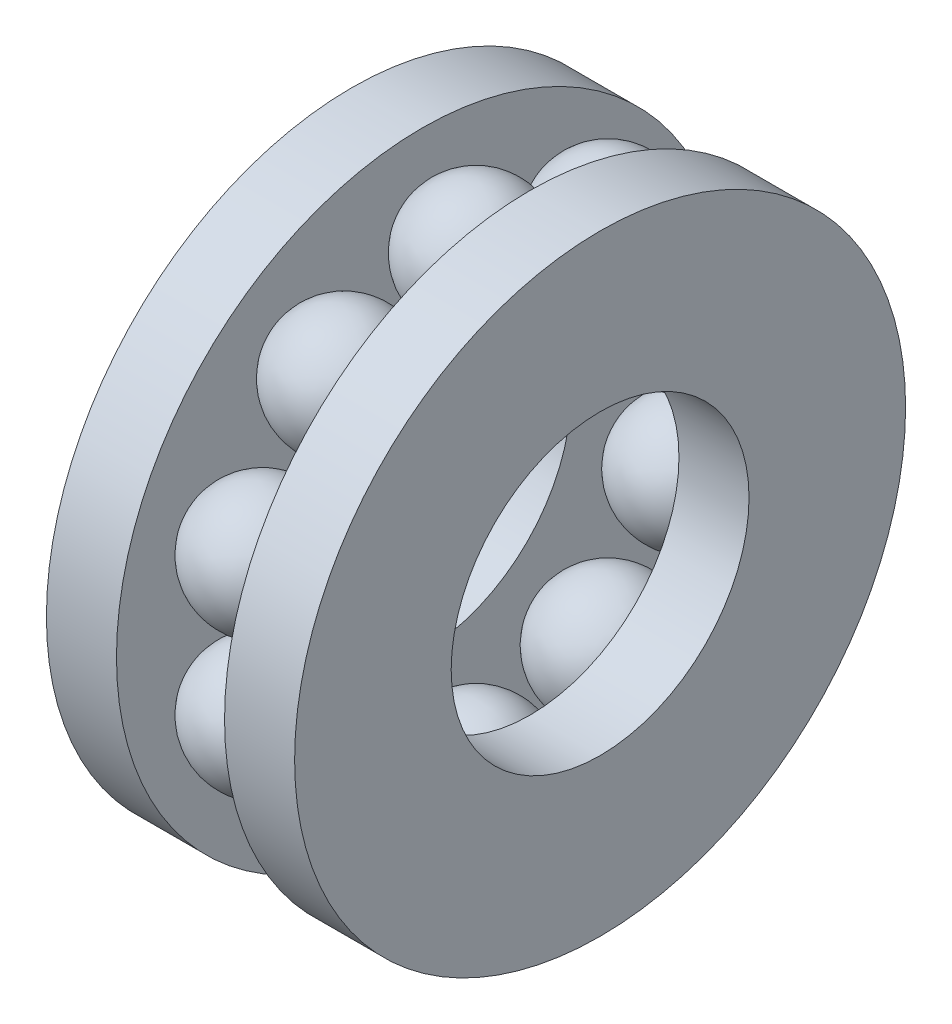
ISO-10303-21;
HEADER;
FILE_DESCRIPTION(('STEP AP214'),'2;1');
FILE_NAME('part.step','',(''),(''),'','','');
FILE_SCHEMA(('AUTOMOTIVE_DESIGN { 1 0 10303 214 1 1 1 1 }'));
ENDSEC;
DATA;
#1=APPLICATION_CONTEXT('core data for automotive mechanical design processes');
#2=APPLICATION_PROTOCOL_DEFINITION('international standard','automotive_design',2000,#1);
#3=PRODUCT_CONTEXT('',#1,'mechanical');
#4=PRODUCT('Part','Part','',(#3));
#5=PRODUCT_RELATED_PRODUCT_CATEGORY('part','',(#4));
#6=PRODUCT_DEFINITION_FORMATION('','',#4);
#7=PRODUCT_DEFINITION_CONTEXT('part definition',#1,'design');
#8=PRODUCT_DEFINITION('design','',#6,#7);
#9=PRODUCT_DEFINITION_SHAPE('','',#8);
#10=(LENGTH_UNIT() NAMED_UNIT(*) SI_UNIT(.MILLI.,.METRE.));
#11=(NAMED_UNIT(*) PLANE_ANGLE_UNIT() SI_UNIT($,.RADIAN.));
#12=(NAMED_UNIT(*) SI_UNIT($,.STERADIAN.) SOLID_ANGLE_UNIT());
#13=UNCERTAINTY_MEASURE_WITH_UNIT(LENGTH_MEASURE(1.E-05),#10,'distance_accuracy_value','');
#14=(GEOMETRIC_REPRESENTATION_CONTEXT(3) GLOBAL_UNCERTAINTY_ASSIGNED_CONTEXT((#13)) GLOBAL_UNIT_ASSIGNED_CONTEXT((#10,
#11,#12)) REPRESENTATION_CONTEXT('',''));
#15=CARTESIAN_POINT('',(0.,0.,0.));
#16=DIRECTION('',(0.,0.,1.));
#17=DIRECTION('',(1.,0.,0.));
#18=AXIS2_PLACEMENT_3D('',#15,#16,#17);
#19=CARTESIAN_POINT('',(0.,39.,0.));
#20=DIRECTION('',(1.,0.,0.));
#21=DIRECTION('',(0.,0.,-1.));
#22=AXIS2_PLACEMENT_3D('',#19,#20,#21);
#23=PLANE('',#22);
#24=CARTESIAN_POINT('',(0.,0.,0.));
#25=DIRECTION('',(1.,0.,0.));
#26=DIRECTION('',(0.,0.,-1.));
#27=AXIS2_PLACEMENT_3D('',#24,#25,#26);
#28=CIRCLE('',#27,80.);
#29=CARTESIAN_POINT('',(0.,0.,-80.));
#30=VERTEX_POINT('',#29);
#31=EDGE_CURVE('E86',#30,#30,#28,.T.);
#32=ORIENTED_EDGE('',*,*,#31,.T.);
#33=EDGE_LOOP('',(#32));
#34=FACE_BOUND('',#33,.T.);
#35=CARTESIAN_POINT('',(0.,0.,0.));
#36=DIRECTION('',(1.,0.,0.));
#37=DIRECTION('',(0.,0.,-1.));
#38=AXIS2_PLACEMENT_3D('',#35,#36,#37);
#39=CIRCLE('',#38,39.);
#40=CARTESIAN_POINT('',(0.,0.,-39.));
#41=VERTEX_POINT('',#40);
#42=EDGE_CURVE('E95',#41,#41,#39,.T.);
#43=ORIENTED_EDGE('',*,*,#42,.F.);
#44=EDGE_LOOP('',(#43));
#45=FACE_BOUND('',#44,.T.);
#46=ADVANCED_FACE('F30',(#34,#45),#23,.T.);
#47=CARTESIAN_POINT('',(0.,0.,0.));
#48=DIRECTION('',(1.,0.,0.));
#49=DIRECTION('',(0.,0.,-1.));
#50=AXIS2_PLACEMENT_3D('',#47,#48,#49);
#51=CYLINDRICAL_SURFACE('',#50,39.);
#52=ORIENTED_EDGE('',*,*,#42,.T.);
#53=EDGE_LOOP('',(#52));
#54=FACE_BOUND('',#53,.T.);
#55=CARTESIAN_POINT('',(-18.35,0.,0.));
#56=DIRECTION('',(1.,0.,0.));
#57=DIRECTION('',(0.,0.,-1.));
#58=AXIS2_PLACEMENT_3D('',#55,#56,#57);
#59=CIRCLE('',#58,39.);
#60=CARTESIAN_POINT('',(-18.35,0.,-39.));
#61=VERTEX_POINT('',#60);
#62=EDGE_CURVE('E92',#61,#61,#59,.T.);
#63=ORIENTED_EDGE('',*,*,#62,.F.);
#64=EDGE_LOOP('',(#63));
#65=FACE_BOUND('',#64,.T.);
#66=ADVANCED_FACE('F172',(#54,#65),#51,.F.);
#67=CARTESIAN_POINT('',(-18.35,39.,0.));
#68=DIRECTION('',(-1.,0.,0.));
#69=DIRECTION('',(0.,0.,1.));
#70=AXIS2_PLACEMENT_3D('',#67,#68,#69);
#71=PLANE('',#70);
#72=CARTESIAN_POINT('',(-18.35,47.5297484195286,-34.5323835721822));
#73=DIRECTION('',(-1.,0.,0.));
#74=DIRECTION('',(0.,0.,1.));
#75=AXIS2_PLACEMENT_3D('',#72,#73,#74);
#76=CIRCLE('',#75,7.98999374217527);
#77=CARTESIAN_POINT('',(-18.35,41.0657076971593,-29.8359830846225));
#78=VERTEX_POINT('',#77);
#79=EDGE_CURVE('E10',#78,#78,#76,.T.);
#80=ORIENTED_EDGE('',*,*,#79,.F.);
#81=EDGE_LOOP('',(#80));
#82=FACE_BOUND('',#81,.T.);
#83=CARTESIAN_POINT('',(-18.35,18.1547484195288,-55.8745703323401));
#84=DIRECTION('',(-1.,0.,0.));
#85=DIRECTION('',(0.,0.,1.));
#86=AXIS2_PLACEMENT_3D('',#83,#84,#85);
#87=CIRCLE('',#86,7.98999374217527);
#88=CARTESIAN_POINT('',(-18.35,15.6857045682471,-48.2756347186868));
#89=VERTEX_POINT('',#88);
#90=EDGE_CURVE('E41',#89,#89,#87,.T.);
#91=ORIENTED_EDGE('',*,*,#90,.F.);
#92=EDGE_LOOP('',(#91));
#93=FACE_BOUND('',#92,.T.);
#94=CARTESIAN_POINT('',(-18.35,-18.1547484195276,-55.8745703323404));
#95=DIRECTION('',(-1.,0.,0.));
#96=DIRECTION('',(0.,0.,1.));
#97=AXIS2_PLACEMENT_3D('',#94,#95,#96);
#98=CIRCLE('',#97,7.98999374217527);
#99=CARTESIAN_POINT('',(-18.35,-15.6857045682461,-48.2756347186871));
#100=VERTEX_POINT('',#99);
#101=EDGE_CURVE('E46',#100,#100,#98,.T.);
#102=ORIENTED_EDGE('',*,*,#101,.F.);
#103=EDGE_LOOP('',(#102));
#104=FACE_BOUND('',#103,.T.);
#105=CARTESIAN_POINT('',(-18.35,-47.5297484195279,-34.5323835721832));
#106=DIRECTION('',(-1.,0.,0.));
#107=DIRECTION('',(0.,0.,1.));
#108=AXIS2_PLACEMENT_3D('',#105,#106,#107);
#109=CIRCLE('',#108,7.98999374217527);
#110=CARTESIAN_POINT('',(-18.35,-41.0657076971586,-29.8359830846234));
#111=VERTEX_POINT('',#110);
#112=EDGE_CURVE('E50',#111,#111,#109,.T.);
#113=ORIENTED_EDGE('',*,*,#112,.F.);
#114=EDGE_LOOP('',(#113));
#115=FACE_BOUND('',#114,.T.);
#116=CARTESIAN_POINT('',(-18.35,-58.75,0.));
#117=DIRECTION('',(-1.,0.,0.));
#118=DIRECTION('',(0.,0.,1.));
#119=AXIS2_PLACEMENT_3D('',#116,#117,#118);
#120=CIRCLE('',#119,7.98999374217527);
#121=CARTESIAN_POINT('',(-18.35,-50.7600062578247,0.));
#122=VERTEX_POINT('',#121);
#123=EDGE_CURVE('E54',#122,#122,#120,.T.);
#124=ORIENTED_EDGE('',*,*,#123,.F.);
#125=EDGE_LOOP('',(#124));
#126=FACE_BOUND('',#125,.T.);
#127=CARTESIAN_POINT('',(-18.35,-47.5297484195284,34.5323835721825));
#128=DIRECTION('',(-1.,0.,0.));
#129=DIRECTION('',(0.,0.,1.));
#130=AXIS2_PLACEMENT_3D('',#127,#128,#129);
#131=CIRCLE('',#130,7.98999374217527);
#132=CARTESIAN_POINT('',(-18.35,-41.0657076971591,29.8359830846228));
#133=VERTEX_POINT('',#132);
#134=EDGE_CURVE('E58',#133,#133,#131,.T.);
#135=ORIENTED_EDGE('',*,*,#134,.F.);
#136=EDGE_LOOP('',(#135));
#137=FACE_BOUND('',#136,.T.);
#138=CARTESIAN_POINT('',(-18.35,-18.1547484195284,55.8745703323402));
#139=DIRECTION('',(-1.,0.,0.));
#140=DIRECTION('',(0.,0.,1.));
#141=AXIS2_PLACEMENT_3D('',#138,#139,#140);
#142=CIRCLE('',#141,7.98999374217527);
#143=CARTESIAN_POINT('',(-18.35,-15.6857045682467,48.2756347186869));
#144=VERTEX_POINT('',#143);
#145=EDGE_CURVE('E62',#144,#144,#142,.T.);
#146=ORIENTED_EDGE('',*,*,#145,.F.);
#147=EDGE_LOOP('',(#146));
#148=FACE_BOUND('',#147,.T.);
#149=CARTESIAN_POINT('',(-18.35,18.154748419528,55.8745703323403));
#150=DIRECTION('',(-1.,0.,0.));
#151=DIRECTION('',(0.,0.,1.));
#152=AXIS2_PLACEMENT_3D('',#149,#150,#151);
#153=CIRCLE('',#152,7.98999374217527);
#154=CARTESIAN_POINT('',(-18.35,15.6857045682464,48.275634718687));
#155=VERTEX_POINT('',#154);
#156=EDGE_CURVE('E66',#155,#155,#153,.T.);
#157=ORIENTED_EDGE('',*,*,#156,.F.);
#158=EDGE_LOOP('',(#157));
#159=FACE_BOUND('',#158,.T.);
#160=CARTESIAN_POINT('',(-18.35,47.5297484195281,34.5323835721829));
#161=DIRECTION('',(-1.,0.,0.));
#162=DIRECTION('',(0.,0.,1.));
#163=AXIS2_PLACEMENT_3D('',#160,#161,#162);
#164=CIRCLE('',#163,7.98999374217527);
#165=CARTESIAN_POINT('',(-18.35,41.0657076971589,29.8359830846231));
#166=VERTEX_POINT('',#165);
#167=EDGE_CURVE('E70',#166,#166,#164,.T.);
#168=ORIENTED_EDGE('',*,*,#167,.F.);
#169=EDGE_LOOP('',(#168));
#170=FACE_BOUND('',#169,.T.);
#171=CARTESIAN_POINT('',(-18.35,58.75,0.));
#172=DIRECTION('',(-1.,0.,0.));
#173=DIRECTION('',(0.,0.,1.));
#174=AXIS2_PLACEMENT_3D('',#171,#172,#173);
#175=CIRCLE('',#174,7.98999374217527);
#176=CARTESIAN_POINT('',(-18.35,50.7600062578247,0.));
#177=VERTEX_POINT('',#176);
#178=EDGE_CURVE('E98',#177,#177,#175,.T.);
#179=ORIENTED_EDGE('',*,*,#178,.F.);
#180=EDGE_LOOP('',(#179));
#181=FACE_BOUND('',#180,.T.);
#182=ORIENTED_EDGE('',*,*,#62,.T.);
#183=EDGE_LOOP('',(#182));
#184=FACE_BOUND('',#183,.T.);
#185=CARTESIAN_POINT('',(-18.35,0.,0.));
#186=DIRECTION('',(1.,0.,0.));
#187=DIRECTION('',(0.,0.,-1.));
#188=AXIS2_PLACEMENT_3D('',#185,#186,#187);
#189=CIRCLE('',#188,80.);
#190=CARTESIAN_POINT('',(-18.35,0.,-80.));
#191=VERTEX_POINT('',#190);
#192=EDGE_CURVE('E89',#191,#191,#189,.T.);
#193=ORIENTED_EDGE('',*,*,#192,.F.);
#194=EDGE_LOOP('',(#193));
#195=FACE_BOUND('',#194,.T.);
#196=ADVANCED_FACE('F177',(#82,#93,#104,#115,#126,#137,#148,#159,#170,#181,#184,#195),#71,.T.);
#197=CARTESIAN_POINT('',(0.,0.,0.));
#198=DIRECTION('',(1.,0.,0.));
#199=DIRECTION('',(0.,0.,-1.));
#200=AXIS2_PLACEMENT_3D('',#197,#198,#199);
#201=CYLINDRICAL_SURFACE('',#200,80.);
#202=ORIENTED_EDGE('',*,*,#192,.T.);
#203=EDGE_LOOP('',(#202));
#204=FACE_BOUND('',#203,.T.);
#205=ORIENTED_EDGE('',*,*,#31,.F.);
#206=EDGE_LOOP('',(#205));
#207=FACE_BOUND('',#206,.T.);
#208=ADVANCED_FACE('F168',(#204,#207),#201,.T.);
#209=CARTESIAN_POINT('',(-32.5,58.75,0.));
#210=DIRECTION('',(1.,0.,0.));
#211=DIRECTION('',(0.,-1.,0.));
#212=AXIS2_PLACEMENT_3D('',#209,#210,#211);
#213=SPHERICAL_SURFACE('',#212,16.25);
#214=CARTESIAN_POINT('',(-46.65,58.75,0.));
#215=DIRECTION('',(1.,0.,0.));
#216=DIRECTION('',(0.,0.,-1.));
#217=AXIS2_PLACEMENT_3D('',#214,#215,#216);
#218=CIRCLE('',#217,7.98999374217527);
#219=CARTESIAN_POINT('',(-46.65,50.7600062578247,0.));
#220=VERTEX_POINT('',#219);
#221=EDGE_CURVE('E101',#220,#220,#218,.F.);
#222=CARTESIAN_POINT('',(-46.65,50.7600062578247,0.));
#223=CARTESIAN_POINT('',(-46.4741083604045,50.4484707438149,0.));
#224=CARTESIAN_POINT('',(-46.2878983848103,50.1427640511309,0.));
#225=CARTESIAN_POINT('',(-45.8957217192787,49.5442968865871,0.));
#226=CARTESIAN_POINT('',(-45.6897550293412,49.2515364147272,0.));
#227=CARTESIAN_POINT('',(-45.2589448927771,48.6802502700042,0.));
#228=CARTESIAN_POINT('',(-45.0341014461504,48.401724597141,0.));
#229=CARTESIAN_POINT('',(-44.5665231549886,47.8601194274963,0.));
#230=CARTESIAN_POINT('',(-44.3237883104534,47.5970399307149,0.));
#231=CARTESIAN_POINT('',(-43.8214844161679,47.0874751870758,0.));
#232=CARTESIAN_POINT('',(-43.5619153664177,46.8409899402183,0.));
#233=CARTESIAN_POINT('',(-43.0270753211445,46.3656883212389,0.));
#234=CARTESIAN_POINT('',(-42.7518043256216,46.1368719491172,0.));
#235=CARTESIAN_POINT('',(-42.1867606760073,45.6979059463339,0.));
#236=CARTESIAN_POINT('',(-41.8969880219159,45.4877563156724,0.));
#237=CARTESIAN_POINT('',(-41.3042046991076,45.0870401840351,0.));
#238=CARTESIAN_POINT('',(-41.0011940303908,44.8964736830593,0.));
#239=CARTESIAN_POINT('',(-40.3832560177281,44.5357548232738,0.));
#240=CARTESIAN_POINT('',(-40.0683286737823,44.3656024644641,0.));
#241=CARTESIAN_POINT('',(-39.4279306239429,44.0464538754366,0.));
#242=CARTESIAN_POINT('',(-39.1024599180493,43.8974576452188,0.));
#243=CARTESIAN_POINT('',(-38.4423944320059,43.621271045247,0.));
#244=CARTESIAN_POINT('',(-38.1077996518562,43.4940806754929,0.));
#245=CARTESIAN_POINT('',(-37.4309450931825,43.2620604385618,0.));
#246=CARTESIAN_POINT('',(-37.0886853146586,43.1572305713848,0.));
#247=CARTESIAN_POINT('',(-36.3979932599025,42.9703884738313,0.));
#248=CARTESIAN_POINT('',(-36.0495609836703,42.8883762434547,0.));
#249=CARTESIAN_POINT('',(-35.3480433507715,42.7475270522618,0.));
#250=CARTESIAN_POINT('',(-34.9949579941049,42.6886900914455,0.));
#251=CARTESIAN_POINT('',(-34.2856739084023,42.5944480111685,0.));
#252=CARTESIAN_POINT('',(-33.9294751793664,42.5590428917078,0.));
#253=CARTESIAN_POINT('',(-33.2155176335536,42.5118188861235,0.));
#254=CARTESIAN_POINT('',(-32.8577588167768,42.5,0.));
#255=CARTESIAN_POINT('',(-32.1422411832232,42.5,0.));
#256=CARTESIAN_POINT('',(-31.7844823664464,42.5118188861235,0.));
#257=CARTESIAN_POINT('',(-31.0705248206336,42.5590428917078,0.));
#258=CARTESIAN_POINT('',(-30.7143260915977,42.5944480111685,0.));
#259=CARTESIAN_POINT('',(-30.0050420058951,42.6886900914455,0.));
#260=CARTESIAN_POINT('',(-29.6519566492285,42.7475270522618,0.));
#261=CARTESIAN_POINT('',(-28.9504390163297,42.8883762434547,0.));
#262=CARTESIAN_POINT('',(-28.6020067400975,42.9703884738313,0.));
#263=CARTESIAN_POINT('',(-27.9113146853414,43.1572305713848,0.));
#264=CARTESIAN_POINT('',(-27.5690549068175,43.2620604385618,0.));
#265=CARTESIAN_POINT('',(-26.8922003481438,43.4940806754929,0.));
#266=CARTESIAN_POINT('',(-26.5576055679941,43.621271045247,0.));
#267=CARTESIAN_POINT('',(-25.8975400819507,43.8974576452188,0.));
#268=CARTESIAN_POINT('',(-25.5720693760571,44.0464538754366,0.));
#269=CARTESIAN_POINT('',(-24.9316713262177,44.3656024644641,0.));
#270=CARTESIAN_POINT('',(-24.6167439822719,44.5357548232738,0.));
#271=CARTESIAN_POINT('',(-23.9988059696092,44.8964736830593,0.));
#272=CARTESIAN_POINT('',(-23.6957953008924,45.0870401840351,0.));
#273=CARTESIAN_POINT('',(-23.1030119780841,45.4877563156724,0.));
#274=CARTESIAN_POINT('',(-22.8132393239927,45.6979059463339,0.));
#275=CARTESIAN_POINT('',(-22.2481956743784,46.1368719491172,0.));
#276=CARTESIAN_POINT('',(-21.9729246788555,46.3656883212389,0.));
#277=CARTESIAN_POINT('',(-21.4380846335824,46.8409899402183,0.));
#278=CARTESIAN_POINT('',(-21.1785155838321,47.0874751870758,0.));
#279=CARTESIAN_POINT('',(-20.6762116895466,47.5970399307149,0.));
#280=CARTESIAN_POINT('',(-20.4334768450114,47.8601194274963,0.));
#281=CARTESIAN_POINT('',(-19.9658985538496,48.401724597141,0.));
#282=CARTESIAN_POINT('',(-19.7410551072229,48.6802502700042,0.));
#283=CARTESIAN_POINT('',(-19.3102449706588,49.2515364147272,0.));
#284=CARTESIAN_POINT('',(-19.1042782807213,49.5442968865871,0.));
#285=CARTESIAN_POINT('',(-18.7121016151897,50.1427640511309,0.));
#286=CARTESIAN_POINT('',(-18.5258916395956,50.4484707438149,0.));
#287=CARTESIAN_POINT('',(-18.35,50.7600062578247,0.));
#288=B_SPLINE_CURVE_WITH_KNOTS('',3,(#222,#223,#224,#225,#226,#227,#228,#229,#230,#231,#232,
#233,#234,#235,#236,#237,#238,#239,#240,#241,#242,#243,#244,#245,#246,#247,#248,#249,#250,#251,
#252,#253,#254,#255,#256,#257,#258,#259,#260,#261,#262,#263,#264,#265,#266,#267,#268,#269,#270,
#271,#272,#273,#274,#275,#276,#277,#278,#279,#280,#281,#282,#283,#284,#285,#286,#287),
.UNSPECIFIED.,.F.,.F.,(4,2,2,2,2,2,2,2,2,2,2,2,2,2,2,2,2,2,2,2,2,2,2,2,2,2,2,2,2,2,2,2,4),(0.,
1.07308149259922,2.14616298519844,3.21924447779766,4.29232597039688,5.36540746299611,
6.43848895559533,7.51157044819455,8.58465194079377,9.657733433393,10.7308149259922,
11.8038964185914,12.8769779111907,13.9500594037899,15.0231408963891,16.0962223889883,
17.1693038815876,18.2423853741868,19.315466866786,20.3885483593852,21.4616298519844,
22.5347113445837,23.6077928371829,24.6808743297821,25.7539558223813,26.8270373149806,
27.9001188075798,28.973200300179,30.0462817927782,31.1193632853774,32.1924447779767,
33.2655262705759,34.3386077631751),.UNSPECIFIED.);
#289=EDGE_CURVE('BSEAM163',#220,#177,#288,.T.);
#290=ORIENTED_EDGE('',*,*,#221,.F.);
#291=ORIENTED_EDGE('',*,*,#178,.T.);
#292=ORIENTED_EDGE('',*,*,#289,.T.);
#293=ORIENTED_EDGE('',*,*,#289,.F.);
#294=EDGE_LOOP('',(#290,#292,#291,#293));
#295=FACE_BOUND('',#294,.T.);
#296=ADVANCED_FACE('F163',(#295),#213,.T.);
#297=CARTESIAN_POINT('',(0.,0.,0.));
#298=DIRECTION('',(1.,0.,0.));
#299=DIRECTION('',(0.,0.,-1.));
#300=AXIS2_PLACEMENT_3D('',#297,#298,#299);
#301=CYLINDRICAL_SURFACE('',#300,80.);
#302=CARTESIAN_POINT('',(-65.,0.,0.));
#303=DIRECTION('',(1.,0.,0.));
#304=DIRECTION('',(0.,0.,-1.));
#305=AXIS2_PLACEMENT_3D('',#302,#303,#304);
#306=CIRCLE('',#305,80.);
#307=CARTESIAN_POINT('',(-65.,0.,-80.));
#308=VERTEX_POINT('',#307);
#309=EDGE_CURVE('E83',#308,#308,#306,.T.);
#310=ORIENTED_EDGE('',*,*,#309,.T.);
#311=EDGE_LOOP('',(#310));
#312=FACE_BOUND('',#311,.T.);
#313=CARTESIAN_POINT('',(-46.65,0.,0.));
#314=DIRECTION('',(1.,0.,0.));
#315=DIRECTION('',(0.,0.,-1.));
#316=AXIS2_PLACEMENT_3D('',#313,#314,#315);
#317=CIRCLE('',#316,80.);
#318=CARTESIAN_POINT('',(-46.65,0.,-80.));
#319=VERTEX_POINT('',#318);
#320=EDGE_CURVE('E74',#319,#319,#317,.T.);
#321=ORIENTED_EDGE('',*,*,#320,.F.);
#322=EDGE_LOOP('',(#321));
#323=FACE_BOUND('',#322,.T.);
#324=ADVANCED_FACE('F157',(#312,#323),#301,.T.);
#325=CARTESIAN_POINT('',(-65.,80.,0.));
#326=DIRECTION('',(-1.,0.,0.));
#327=DIRECTION('',(0.,0.,1.));
#328=AXIS2_PLACEMENT_3D('',#325,#326,#327);
#329=PLANE('',#328);
#330=CARTESIAN_POINT('',(-65.,0.,0.));
#331=DIRECTION('',(1.,0.,0.));
#332=DIRECTION('',(0.,0.,-1.));
#333=AXIS2_PLACEMENT_3D('',#330,#331,#332);
#334=CIRCLE('',#333,39.);
#335=CARTESIAN_POINT('',(-65.,0.,-39.));
#336=VERTEX_POINT('',#335);
#337=EDGE_CURVE('E80',#336,#336,#334,.T.);
#338=ORIENTED_EDGE('',*,*,#337,.T.);
#339=EDGE_LOOP('',(#338));
#340=FACE_BOUND('',#339,.T.);
#341=ORIENTED_EDGE('',*,*,#309,.F.);
#342=EDGE_LOOP('',(#341));
#343=FACE_BOUND('',#342,.T.);
#344=ADVANCED_FACE('F151',(#340,#343),#329,.T.);
#345=CARTESIAN_POINT('',(0.,0.,0.));
#346=DIRECTION('',(1.,0.,0.));
#347=DIRECTION('',(0.,0.,-1.));
#348=AXIS2_PLACEMENT_3D('',#345,#346,#347);
#349=CYLINDRICAL_SURFACE('',#348,39.);
#350=CARTESIAN_POINT('',(-46.65,0.,0.));
#351=DIRECTION('',(1.,0.,0.));
#352=DIRECTION('',(0.,0.,-1.));
#353=AXIS2_PLACEMENT_3D('',#350,#351,#352);
#354=CIRCLE('',#353,39.);
#355=CARTESIAN_POINT('',(-46.65,0.,-39.));
#356=VERTEX_POINT('',#355);
#357=EDGE_CURVE('E77',#356,#356,#354,.T.);
#358=ORIENTED_EDGE('',*,*,#357,.T.);
#359=EDGE_LOOP('',(#358));
#360=FACE_BOUND('',#359,.T.);
#361=ORIENTED_EDGE('',*,*,#337,.F.);
#362=EDGE_LOOP('',(#361));
#363=FACE_BOUND('',#362,.T.);
#364=ADVANCED_FACE('F126',(#360,#363),#349,.F.);
#365=CARTESIAN_POINT('',(-46.65,39.,0.));
#366=DIRECTION('',(1.,0.,0.));
#367=DIRECTION('',(0.,0.,-1.));
#368=AXIS2_PLACEMENT_3D('',#365,#366,#367);
#369=PLANE('',#368);
#370=CARTESIAN_POINT('',(-46.65,47.5297484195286,-34.5323835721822));
#371=DIRECTION('',(1.,0.,0.));
#372=DIRECTION('',(0.,0.,-1.));
#373=AXIS2_PLACEMENT_3D('',#370,#371,#372);
#374=CIRCLE('',#373,7.98999374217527);
#375=CARTESIAN_POINT('',(-46.65,41.0657076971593,-29.8359830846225));
#376=VERTEX_POINT('',#375);
#377=EDGE_CURVE('E33',#376,#376,#374,.T.);
#378=ORIENTED_EDGE('',*,*,#377,.F.);
#379=EDGE_LOOP('',(#378));
#380=FACE_BOUND('',#379,.T.);
#381=CARTESIAN_POINT('',(-46.65,18.1547484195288,-55.8745703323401));
#382=DIRECTION('',(1.,0.,0.));
#383=DIRECTION('',(0.,0.,-1.));
#384=AXIS2_PLACEMENT_3D('',#381,#382,#383);
#385=CIRCLE('',#384,7.98999374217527);
#386=CARTESIAN_POINT('',(-46.65,15.6857045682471,-48.2756347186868));
#387=VERTEX_POINT('',#386);
#388=EDGE_CURVE('E45',#387,#387,#385,.T.);
#389=ORIENTED_EDGE('',*,*,#388,.F.);
#390=EDGE_LOOP('',(#389));
#391=FACE_BOUND('',#390,.T.);
#392=CARTESIAN_POINT('',(-46.65,-18.1547484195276,-55.8745703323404));
#393=DIRECTION('',(1.,0.,0.));
#394=DIRECTION('',(0.,0.,-1.));
#395=AXIS2_PLACEMENT_3D('',#392,#393,#394);
#396=CIRCLE('',#395,7.98999374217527);
#397=CARTESIAN_POINT('',(-46.65,-15.6857045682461,-48.2756347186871));
#398=VERTEX_POINT('',#397);
#399=EDGE_CURVE('E49',#398,#398,#396,.T.);
#400=ORIENTED_EDGE('',*,*,#399,.F.);
#401=EDGE_LOOP('',(#400));
#402=FACE_BOUND('',#401,.T.);
#403=CARTESIAN_POINT('',(-46.65,-47.5297484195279,-34.5323835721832));
#404=DIRECTION('',(1.,0.,0.));
#405=DIRECTION('',(0.,0.,-1.));
#406=AXIS2_PLACEMENT_3D('',#403,#404,#405);
#407=CIRCLE('',#406,7.98999374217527);
#408=CARTESIAN_POINT('',(-46.65,-41.0657076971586,-29.8359830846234));
#409=VERTEX_POINT('',#408);
#410=EDGE_CURVE('E53',#409,#409,#407,.T.);
#411=ORIENTED_EDGE('',*,*,#410,.F.);
#412=EDGE_LOOP('',(#411));
#413=FACE_BOUND('',#412,.T.);
#414=CARTESIAN_POINT('',(-46.65,-58.75,0.));
#415=DIRECTION('',(1.,0.,0.));
#416=DIRECTION('',(0.,0.,-1.));
#417=AXIS2_PLACEMENT_3D('',#414,#415,#416);
#418=CIRCLE('',#417,7.98999374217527);
#419=CARTESIAN_POINT('',(-46.65,-50.7600062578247,0.));
#420=VERTEX_POINT('',#419);
#421=EDGE_CURVE('E57',#420,#420,#418,.T.);
#422=ORIENTED_EDGE('',*,*,#421,.F.);
#423=EDGE_LOOP('',(#422));
#424=FACE_BOUND('',#423,.T.);
#425=CARTESIAN_POINT('',(-46.65,-47.5297484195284,34.5323835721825));
#426=DIRECTION('',(1.,0.,0.));
#427=DIRECTION('',(0.,0.,-1.));
#428=AXIS2_PLACEMENT_3D('',#425,#426,#427);
#429=CIRCLE('',#428,7.98999374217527);
#430=CARTESIAN_POINT('',(-46.65,-41.0657076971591,29.8359830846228));
#431=VERTEX_POINT('',#430);
#432=EDGE_CURVE('E61',#431,#431,#429,.T.);
#433=ORIENTED_EDGE('',*,*,#432,.F.);
#434=EDGE_LOOP('',(#433));
#435=FACE_BOUND('',#434,.T.);
#436=CARTESIAN_POINT('',(-46.65,-18.1547484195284,55.8745703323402));
#437=DIRECTION('',(1.,0.,0.));
#438=DIRECTION('',(0.,0.,-1.));
#439=AXIS2_PLACEMENT_3D('',#436,#437,#438);
#440=CIRCLE('',#439,7.98999374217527);
#441=CARTESIAN_POINT('',(-46.65,-15.6857045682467,48.2756347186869));
#442=VERTEX_POINT('',#441);
#443=EDGE_CURVE('E65',#442,#442,#440,.T.);
#444=ORIENTED_EDGE('',*,*,#443,.F.);
#445=EDGE_LOOP('',(#444));
#446=FACE_BOUND('',#445,.T.);
#447=CARTESIAN_POINT('',(-46.65,18.154748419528,55.8745703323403));
#448=DIRECTION('',(1.,0.,0.));
#449=DIRECTION('',(0.,0.,-1.));
#450=AXIS2_PLACEMENT_3D('',#447,#448,#449);
#451=CIRCLE('',#450,7.98999374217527);
#452=CARTESIAN_POINT('',(-46.65,15.6857045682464,48.275634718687));
#453=VERTEX_POINT('',#452);
#454=EDGE_CURVE('E69',#453,#453,#451,.T.);
#455=ORIENTED_EDGE('',*,*,#454,.F.);
#456=EDGE_LOOP('',(#455));
#457=FACE_BOUND('',#456,.T.);
#458=CARTESIAN_POINT('',(-46.65,47.5297484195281,34.5323835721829));
#459=DIRECTION('',(1.,0.,0.));
#460=DIRECTION('',(0.,0.,-1.));
#461=AXIS2_PLACEMENT_3D('',#458,#459,#460);
#462=CIRCLE('',#461,7.98999374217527);
#463=CARTESIAN_POINT('',(-46.65,41.0657076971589,29.8359830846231));
#464=VERTEX_POINT('',#463);
#465=EDGE_CURVE('E73',#464,#464,#462,.T.);
#466=ORIENTED_EDGE('',*,*,#465,.F.);
#467=EDGE_LOOP('',(#466));
#468=FACE_BOUND('',#467,.T.);
#469=ORIENTED_EDGE('',*,*,#221,.T.);
#470=EDGE_LOOP('',(#469));
#471=FACE_BOUND('',#470,.T.);
#472=ORIENTED_EDGE('',*,*,#320,.T.);
#473=EDGE_LOOP('',(#472));
#474=FACE_BOUND('',#473,.T.);
#475=ORIENTED_EDGE('',*,*,#357,.F.);
#476=EDGE_LOOP('',(#475));
#477=FACE_BOUND('',#476,.T.);
#478=ADVANCED_FACE('F122',(#380,#391,#402,#413,#424,#435,#446,#457,#468,#471,#474,#477),#369,.T.);
#479=CARTESIAN_POINT('',(-32.5,47.5297484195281,34.5323835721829));
#480=DIRECTION('',(1.,0.,0.));
#481=DIRECTION('',(0.,-0.809016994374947,-0.587785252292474));
#482=AXIS2_PLACEMENT_3D('',#479,#480,#481);
#483=SPHERICAL_SURFACE('',#482,16.25);
#484=CARTESIAN_POINT('',(-18.35,41.0657076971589,29.8359830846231));
#485=CARTESIAN_POINT('',(-18.5258916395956,40.8136701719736,29.6528671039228));
#486=CARTESIAN_POINT('',(-18.7121016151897,40.5663482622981,29.473177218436));
#487=CARTESIAN_POINT('',(-19.1042782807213,40.0821781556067,29.1214070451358));
#488=CARTESIAN_POINT('',(-19.3102449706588,39.8453299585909,28.9493267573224));
#489=CARTESIAN_POINT('',(-19.7410551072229,39.383149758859,28.6135331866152));
#490=CARTESIAN_POINT('',(-19.9658985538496,39.1578177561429,28.4498199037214));
#491=CARTESIAN_POINT('',(-20.4334768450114,38.7196499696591,28.1314723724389));
#492=CARTESIAN_POINT('',(-20.6762116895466,38.5068141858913,27.9768381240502));
#493=CARTESIAN_POINT('',(-21.1785155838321,38.094567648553,27.677323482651));
#494=CARTESIAN_POINT('',(-21.4380846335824,37.8951568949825,27.5324430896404));
#495=CARTESIAN_POINT('',(-21.9729246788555,37.5106298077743,27.2530678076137));
#496=CARTESIAN_POINT('',(-22.2481956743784,37.3255134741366,27.1185729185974));
#497=CARTESIAN_POINT('',(-22.8132393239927,36.9703825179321,26.8605551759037));
#498=CARTESIAN_POINT('',(-23.1030119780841,36.8003678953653,26.7370323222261));
#499=CARTESIAN_POINT('',(-23.6957953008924,36.4761817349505,26.501497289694));
#500=CARTESIAN_POINT('',(-23.9988059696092,36.3220101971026,26.3894851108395));
#501=CARTESIAN_POINT('',(-24.6167439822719,36.0301825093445,26.1774598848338));
#502=CARTESIAN_POINT('',(-24.9316713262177,35.8925263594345,26.0774468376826));
#503=CARTESIAN_POINT('',(-25.5720693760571,35.6343297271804,25.8898560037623));
#504=CARTESIAN_POINT('',(-25.8975400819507,35.5137892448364,25.8022782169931));
#505=CARTESIAN_POINT('',(-26.5576055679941,35.2903495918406,25.6399398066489));
#506=CARTESIAN_POINT('',(-26.8922003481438,35.1874504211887,25.5651791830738));
#507=CARTESIAN_POINT('',(-27.5690549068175,34.9997421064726,25.4288011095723));
#508=CARTESIAN_POINT('',(-27.9113146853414,34.9149329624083,25.3671836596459));
#509=CARTESIAN_POINT('',(-28.6020067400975,34.7637745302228,25.2573606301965));
#510=CARTESIAN_POINT('',(-28.9504390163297,34.6974252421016,25.2091550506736));
#511=CARTESIAN_POINT('',(-29.6519566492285,34.5834758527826,25.1263659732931));
#512=CARTESIAN_POINT('',(-30.0050420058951,34.5358757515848,25.0917824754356));
#513=CARTESIAN_POINT('',(-30.7143260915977,34.4596323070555,25.0363883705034));
#514=CARTESIAN_POINT('',(-31.0705248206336,34.4309889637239,25.0155777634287));
#515=CARTESIAN_POINT('',(-31.7844823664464,34.3927839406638,24.9878201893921));
#516=CARTESIAN_POINT('',(-32.1422411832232,34.3832222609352,24.9808732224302));
#517=CARTESIAN_POINT('',(-32.8577588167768,34.3832222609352,24.9808732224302));
#518=CARTESIAN_POINT('',(-33.2155176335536,34.3927839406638,24.9878201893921));
#519=CARTESIAN_POINT('',(-33.9294751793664,34.4309889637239,25.0155777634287));
#520=CARTESIAN_POINT('',(-34.2856739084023,34.4596323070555,25.0363883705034));
#521=CARTESIAN_POINT('',(-34.9949579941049,34.5358757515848,25.0917824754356));
#522=CARTESIAN_POINT('',(-35.3480433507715,34.5834758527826,25.1263659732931));
#523=CARTESIAN_POINT('',(-36.0495609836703,34.6974252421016,25.2091550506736));
#524=CARTESIAN_POINT('',(-36.3979932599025,34.7637745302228,25.2573606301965));
#525=CARTESIAN_POINT('',(-37.0886853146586,34.9149329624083,25.3671836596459));
#526=CARTESIAN_POINT('',(-37.4309450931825,34.9997421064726,25.4288011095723));
#527=CARTESIAN_POINT('',(-38.1077996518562,35.1874504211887,25.5651791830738));
#528=CARTESIAN_POINT('',(-38.4423944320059,35.2903495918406,25.6399398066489));
#529=CARTESIAN_POINT('',(-39.1024599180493,35.5137892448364,25.8022782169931));
#530=CARTESIAN_POINT('',(-39.4279306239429,35.6343297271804,25.8898560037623));
#531=CARTESIAN_POINT('',(-40.0683286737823,35.8925263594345,26.0774468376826));
#532=CARTESIAN_POINT('',(-40.3832560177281,36.0301825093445,26.1774598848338));
#533=CARTESIAN_POINT('',(-41.0011940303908,36.3220101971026,26.3894851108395));
#534=CARTESIAN_POINT('',(-41.3042046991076,36.4761817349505,26.501497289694));
#535=CARTESIAN_POINT('',(-41.8969880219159,36.8003678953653,26.7370323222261));
#536=CARTESIAN_POINT('',(-42.1867606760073,36.9703825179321,26.8605551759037));
#537=CARTESIAN_POINT('',(-42.7518043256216,37.3255134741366,27.1185729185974));
#538=CARTESIAN_POINT('',(-43.0270753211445,37.5106298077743,27.2530678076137));
#539=CARTESIAN_POINT('',(-43.5619153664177,37.8951568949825,27.5324430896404));
#540=CARTESIAN_POINT('',(-43.8214844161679,38.094567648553,27.677323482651));
#541=CARTESIAN_POINT('',(-44.3237883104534,38.5068141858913,27.9768381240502));
#542=CARTESIAN_POINT('',(-44.5665231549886,38.7196499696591,28.1314723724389));
#543=CARTESIAN_POINT('',(-45.0341014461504,39.1578177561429,28.4498199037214));
#544=CARTESIAN_POINT('',(-45.2589448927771,39.383149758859,28.6135331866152));
#545=CARTESIAN_POINT('',(-45.6897550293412,39.8453299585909,28.9493267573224));
#546=CARTESIAN_POINT('',(-45.8957217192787,40.0821781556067,29.1214070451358));
#547=CARTESIAN_POINT('',(-46.2878983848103,40.5663482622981,29.473177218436));
#548=CARTESIAN_POINT('',(-46.4741083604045,40.8136701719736,29.6528671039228));
#549=CARTESIAN_POINT('',(-46.65,41.0657076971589,29.8359830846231));
#550=B_SPLINE_CURVE_WITH_KNOTS('',3,(#484,#485,#486,#487,#488,#489,#490,#491,#492,#493,#494,
#495,#496,#497,#498,#499,#500,#501,#502,#503,#504,#505,#506,#507,#508,#509,#510,#511,#512,#513,
#514,#515,#516,#517,#518,#519,#520,#521,#522,#523,#524,#525,#526,#527,#528,#529,#530,#531,#532,
#533,#534,#535,#536,#537,#538,#539,#540,#541,#542,#543,#544,#545,#546,#547,#548,#549),
.UNSPECIFIED.,.F.,.F.,(4,2,2,2,2,2,2,2,2,2,2,2,2,2,2,2,2,2,2,2,2,2,2,2,2,2,2,2,2,2,2,2,4),(0.,
1.07308149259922,2.14616298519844,3.21924447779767,4.29232597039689,5.36540746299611,
6.43848895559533,7.51157044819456,8.58465194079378,9.657733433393,10.7308149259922,
11.8038964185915,12.8769779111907,13.9500594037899,15.0231408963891,16.0962223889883,
17.1693038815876,18.2423853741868,19.315466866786,20.3885483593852,21.4616298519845,
22.5347113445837,23.6077928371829,24.6808743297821,25.7539558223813,26.8270373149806,
27.9001188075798,28.973200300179,30.0462817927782,31.1193632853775,32.1924447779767,
33.2655262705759,34.3386077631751),.UNSPECIFIED.);
#551=EDGE_CURVE('BSEAM125',#166,#464,#550,.T.);
#552=ORIENTED_EDGE('',*,*,#167,.T.);
#553=ORIENTED_EDGE('',*,*,#465,.T.);
#554=ORIENTED_EDGE('',*,*,#551,.T.);
#555=ORIENTED_EDGE('',*,*,#551,.F.);
#556=EDGE_LOOP('',(#552,#554,#553,#555));
#557=FACE_BOUND('',#556,.T.);
#558=ADVANCED_FACE('F125',(#557),#483,.T.);
#559=CARTESIAN_POINT('',(-32.5,18.154748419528,55.8745703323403));
#560=DIRECTION('',(1.,0.,0.));
#561=DIRECTION('',(0.,-0.309016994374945,-0.951056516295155));
#562=AXIS2_PLACEMENT_3D('',#559,#560,#561);
#563=SPHERICAL_SURFACE('',#562,16.25);
#564=CARTESIAN_POINT('',(-18.35,15.6857045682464,48.275634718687));
#565=CARTESIAN_POINT('',(-18.5258916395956,15.589434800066,47.9793468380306));
#566=CARTESIAN_POINT('',(-18.7121016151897,15.4949662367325,47.6886024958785));
#567=CARTESIAN_POINT('',(-19.1042782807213,15.3100297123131,47.1194263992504));
#568=CARTESIAN_POINT('',(-19.3102449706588,15.2195617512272,46.8409946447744));
#569=CARTESIAN_POINT('',(-19.7410551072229,15.0430246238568,46.2976692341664));
#570=CARTESIAN_POINT('',(-19.9658985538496,14.9569554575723,46.0327755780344));
#571=CARTESIAN_POINT('',(-20.4334768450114,14.7895902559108,45.5176784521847));
#572=CARTESIAN_POINT('',(-20.6762116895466,14.7082942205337,45.2674749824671));
#573=CARTESIAN_POINT('',(-21.1785155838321,14.550830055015,44.7828501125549));
#574=CARTESIAN_POINT('',(-21.4380846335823,14.4746619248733,44.5484287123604));
#575=CARTESIAN_POINT('',(-21.9729246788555,14.3277856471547,44.0963900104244));
#576=CARTESIAN_POINT('',(-22.2481956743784,14.2570774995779,43.8787727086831));
#577=CARTESIAN_POINT('',(-22.8132393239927,14.121429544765,43.461291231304));
#578=CARTESIAN_POINT('',(-23.1030119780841,14.056489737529,43.2614270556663));
#579=CARTESIAN_POINT('',(-23.6957953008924,13.9326616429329,42.8803233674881));
#580=CARTESIAN_POINT('',(-23.9988059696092,13.8737733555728,42.6990838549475));
#581=CARTESIAN_POINT('',(-24.6167439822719,13.7623050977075,42.3560198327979));
#582=CARTESIAN_POINT('',(-24.9316713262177,13.7097251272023,42.1941953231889));
#583=CARTESIAN_POINT('',(-25.5720693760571,13.611102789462,41.8906669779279));
#584=CARTESIAN_POINT('',(-25.8975400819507,13.565060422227,41.7489631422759));
#585=CARTESIAN_POINT('',(-26.5576055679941,13.479714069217,41.4862940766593));
#586=CARTESIAN_POINT('',(-26.8922003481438,13.4404100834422,41.3653288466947));
#587=CARTESIAN_POINT('',(-27.5690549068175,13.3687118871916,41.144664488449));
#588=CARTESIAN_POINT('',(-27.9113146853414,13.3363176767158,41.044965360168));
#589=CARTESIAN_POINT('',(-28.6020067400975,13.2785802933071,40.8672679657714));
#590=CARTESIAN_POINT('',(-28.9504390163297,13.2532371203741,40.7892696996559));
#591=CARTESIAN_POINT('',(-29.6519566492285,13.2097123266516,40.655314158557));
#592=CARTESIAN_POINT('',(-30.0050420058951,13.191530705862,40.5993568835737));
#593=CARTESIAN_POINT('',(-30.7143260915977,13.1624083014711,40.509727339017));
#594=CARTESIAN_POINT('',(-31.0705248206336,13.1514675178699,40.4760550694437));
#595=CARTESIAN_POINT('',(-31.7844823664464,13.1368744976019,40.4311423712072));
#596=CARTESIAN_POINT('',(-32.1422411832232,13.1332222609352,40.4199019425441));
#597=CARTESIAN_POINT('',(-32.8577588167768,13.1332222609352,40.4199019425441));
#598=CARTESIAN_POINT('',(-33.2155176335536,13.1368744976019,40.4311423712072));
#599=CARTESIAN_POINT('',(-33.9294751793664,13.1514675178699,40.4760550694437));
#600=CARTESIAN_POINT('',(-34.2856739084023,13.1624083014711,40.509727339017));
#601=CARTESIAN_POINT('',(-34.9949579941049,13.191530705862,40.5993568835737));
#602=CARTESIAN_POINT('',(-35.3480433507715,13.2097123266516,40.655314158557));
#603=CARTESIAN_POINT('',(-36.0495609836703,13.2532371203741,40.7892696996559));
#604=CARTESIAN_POINT('',(-36.3979932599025,13.2785802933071,40.8672679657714));
#605=CARTESIAN_POINT('',(-37.0886853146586,13.3363176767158,41.044965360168));
#606=CARTESIAN_POINT('',(-37.4309450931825,13.3687118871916,41.144664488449));
#607=CARTESIAN_POINT('',(-38.1077996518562,13.4404100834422,41.3653288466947));
#608=CARTESIAN_POINT('',(-38.4423944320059,13.479714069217,41.4862940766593));
#609=CARTESIAN_POINT('',(-39.1024599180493,13.565060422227,41.7489631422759));
#610=CARTESIAN_POINT('',(-39.4279306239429,13.611102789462,41.8906669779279));
#611=CARTESIAN_POINT('',(-40.0683286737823,13.7097251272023,42.1941953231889));
#612=CARTESIAN_POINT('',(-40.3832560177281,13.7623050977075,42.3560198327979));
#613=CARTESIAN_POINT('',(-41.0011940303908,13.8737733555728,42.6990838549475));
#614=CARTESIAN_POINT('',(-41.3042046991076,13.9326616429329,42.8803233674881));
#615=CARTESIAN_POINT('',(-41.8969880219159,14.056489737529,43.2614270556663));
#616=CARTESIAN_POINT('',(-42.1867606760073,14.121429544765,43.461291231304));
#617=CARTESIAN_POINT('',(-42.7518043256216,14.2570774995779,43.8787727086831));
#618=CARTESIAN_POINT('',(-43.0270753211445,14.3277856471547,44.0963900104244));
#619=CARTESIAN_POINT('',(-43.5619153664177,14.4746619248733,44.5484287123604));
#620=CARTESIAN_POINT('',(-43.8214844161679,14.550830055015,44.7828501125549));
#621=CARTESIAN_POINT('',(-44.3237883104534,14.7082942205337,45.2674749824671));
#622=CARTESIAN_POINT('',(-44.5665231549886,14.7895902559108,45.5176784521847));
#623=CARTESIAN_POINT('',(-45.0341014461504,14.9569554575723,46.0327755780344));
#624=CARTESIAN_POINT('',(-45.2589448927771,15.0430246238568,46.2976692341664));
#625=CARTESIAN_POINT('',(-45.6897550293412,15.2195617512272,46.8409946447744));
#626=CARTESIAN_POINT('',(-45.8957217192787,15.3100297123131,47.1194263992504));
#627=CARTESIAN_POINT('',(-46.2878983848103,15.4949662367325,47.6886024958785));
#628=CARTESIAN_POINT('',(-46.4741083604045,15.589434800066,47.9793468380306));
#629=CARTESIAN_POINT('',(-46.65,15.6857045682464,48.275634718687));
#630=B_SPLINE_CURVE_WITH_KNOTS('',3,(#564,#565,#566,#567,#568,#569,#570,#571,#572,#573,#574,
#575,#576,#577,#578,#579,#580,#581,#582,#583,#584,#585,#586,#587,#588,#589,#590,#591,#592,#593,
#594,#595,#596,#597,#598,#599,#600,#601,#602,#603,#604,#605,#606,#607,#608,#609,#610,#611,#612,
#613,#614,#615,#616,#617,#618,#619,#620,#621,#622,#623,#624,#625,#626,#627,#628,#629),
.UNSPECIFIED.,.F.,.F.,(4,2,2,2,2,2,2,2,2,2,2,2,2,2,2,2,2,2,2,2,2,2,2,2,2,2,2,2,2,2,2,2,4),(0.,
1.07308149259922,2.14616298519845,3.21924447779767,4.29232597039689,5.36540746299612,
6.43848895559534,7.51157044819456,8.58465194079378,9.65773343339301,10.7308149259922,
11.8038964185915,12.8769779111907,13.9500594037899,15.0231408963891,16.0962223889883,
17.1693038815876,18.2423853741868,19.315466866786,20.3885483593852,21.4616298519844,
22.5347113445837,23.6077928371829,24.6808743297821,25.7539558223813,26.8270373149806,
27.9001188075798,28.973200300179,30.0462817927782,31.1193632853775,32.1924447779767,
33.2655262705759,34.3386077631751),.UNSPECIFIED.);
#631=EDGE_CURVE('BSEAM239',#155,#453,#630,.T.);
#632=ORIENTED_EDGE('',*,*,#156,.T.);
#633=ORIENTED_EDGE('',*,*,#454,.T.);
#634=ORIENTED_EDGE('',*,*,#631,.T.);
#635=ORIENTED_EDGE('',*,*,#631,.F.);
#636=EDGE_LOOP('',(#632,#634,#633,#635));
#637=FACE_BOUND('',#636,.T.);
#638=ADVANCED_FACE('F239',(#637),#563,.T.);
#639=CARTESIAN_POINT('',(-32.5,-18.1547484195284,55.8745703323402));
#640=DIRECTION('',(1.,0.,0.));
#641=DIRECTION('',(0.,0.309016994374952,-0.951056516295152));
#642=AXIS2_PLACEMENT_3D('',#639,#640,#641);
#643=SPHERICAL_SURFACE('',#642,16.25);
#644=CARTESIAN_POINT('',(-18.35,-15.6857045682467,48.2756347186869));
#645=CARTESIAN_POINT('',(-18.5258916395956,-15.5894348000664,47.9793468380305));
#646=CARTESIAN_POINT('',(-18.7121016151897,-15.4949662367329,47.6886024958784));
#647=CARTESIAN_POINT('',(-19.1042782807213,-15.3100297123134,47.1194263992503));
#648=CARTESIAN_POINT('',(-19.3102449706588,-15.2195617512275,46.8409946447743));
#649=CARTESIAN_POINT('',(-19.7410551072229,-15.0430246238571,46.2976692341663));
#650=CARTESIAN_POINT('',(-19.9658985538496,-14.9569554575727,46.0327755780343));
#651=CARTESIAN_POINT('',(-20.4334768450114,-14.7895902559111,45.5176784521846));
#652=CARTESIAN_POINT('',(-20.6762116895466,-14.7082942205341,45.2674749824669));
#653=CARTESIAN_POINT('',(-21.1785155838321,-14.5508300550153,44.7828501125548));
#654=CARTESIAN_POINT('',(-21.4380846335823,-14.4746619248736,44.5484287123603));
#655=CARTESIAN_POINT('',(-21.9729246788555,-14.3277856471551,44.0963900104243));
#656=CARTESIAN_POINT('',(-22.2481956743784,-14.2570774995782,43.878772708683));
#657=CARTESIAN_POINT('',(-22.8132393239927,-14.1214295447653,43.4612912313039));
#658=CARTESIAN_POINT('',(-23.1030119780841,-14.0564897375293,43.2614270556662));
#659=CARTESIAN_POINT('',(-23.6957953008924,-13.9326616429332,42.880323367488));
#660=CARTESIAN_POINT('',(-23.9988059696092,-13.8737733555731,42.6990838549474));
#661=CARTESIAN_POINT('',(-24.6167439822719,-13.7623050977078,42.3560198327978));
#662=CARTESIAN_POINT('',(-24.9316713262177,-13.7097251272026,42.1941953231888));
#663=CARTESIAN_POINT('',(-25.5720693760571,-13.6111027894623,41.8906669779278));
#664=CARTESIAN_POINT('',(-25.8975400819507,-13.5650604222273,41.7489631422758));
#665=CARTESIAN_POINT('',(-26.5576055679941,-13.4797140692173,41.4862940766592));
#666=CARTESIAN_POINT('',(-26.8922003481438,-13.4404100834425,41.3653288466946));
#667=CARTESIAN_POINT('',(-27.5690549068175,-13.3687118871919,41.1446644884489));
#668=CARTESIAN_POINT('',(-27.9113146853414,-13.3363176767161,41.0449653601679));
#669=CARTESIAN_POINT('',(-28.6020067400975,-13.2785802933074,40.8672679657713));
#670=CARTESIAN_POINT('',(-28.9504390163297,-13.2532371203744,40.7892696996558));
#671=CARTESIAN_POINT('',(-29.6519566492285,-13.2097123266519,40.6553141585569));
#672=CARTESIAN_POINT('',(-30.0050420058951,-13.1915307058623,40.5993568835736));
#673=CARTESIAN_POINT('',(-30.7143260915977,-13.1624083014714,40.5097273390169));
#674=CARTESIAN_POINT('',(-31.0705248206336,-13.1514675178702,40.4760550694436));
#675=CARTESIAN_POINT('',(-31.7844823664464,-13.1368744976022,40.4311423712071));
#676=CARTESIAN_POINT('',(-32.1422411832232,-13.1332222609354,40.419901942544));
#677=CARTESIAN_POINT('',(-32.8577588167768,-13.1332222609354,40.419901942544));
#678=CARTESIAN_POINT('',(-33.2155176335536,-13.1368744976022,40.4311423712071));
#679=CARTESIAN_POINT('',(-33.9294751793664,-13.1514675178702,40.4760550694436));
#680=CARTESIAN_POINT('',(-34.2856739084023,-13.1624083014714,40.5097273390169));
#681=CARTESIAN_POINT('',(-34.9949579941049,-13.1915307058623,40.5993568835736));
#682=CARTESIAN_POINT('',(-35.3480433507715,-13.2097123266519,40.6553141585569));
#683=CARTESIAN_POINT('',(-36.0495609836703,-13.2532371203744,40.7892696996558));
#684=CARTESIAN_POINT('',(-36.3979932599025,-13.2785802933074,40.8672679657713));
#685=CARTESIAN_POINT('',(-37.0886853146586,-13.3363176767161,41.0449653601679));
#686=CARTESIAN_POINT('',(-37.4309450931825,-13.3687118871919,41.1446644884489));
#687=CARTESIAN_POINT('',(-38.1077996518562,-13.4404100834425,41.3653288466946));
#688=CARTESIAN_POINT('',(-38.4423944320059,-13.4797140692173,41.4862940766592));
#689=CARTESIAN_POINT('',(-39.1024599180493,-13.5650604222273,41.7489631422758));
#690=CARTESIAN_POINT('',(-39.4279306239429,-13.6111027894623,41.8906669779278));
#691=CARTESIAN_POINT('',(-40.0683286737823,-13.7097251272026,42.1941953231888));
#692=CARTESIAN_POINT('',(-40.3832560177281,-13.7623050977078,42.3560198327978));
#693=CARTESIAN_POINT('',(-41.0011940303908,-13.8737733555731,42.6990838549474));
#694=CARTESIAN_POINT('',(-41.3042046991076,-13.9326616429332,42.880323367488));
#695=CARTESIAN_POINT('',(-41.8969880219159,-14.0564897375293,43.2614270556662));
#696=CARTESIAN_POINT('',(-42.1867606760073,-14.1214295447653,43.4612912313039));
#697=CARTESIAN_POINT('',(-42.7518043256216,-14.2570774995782,43.878772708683));
#698=CARTESIAN_POINT('',(-43.0270753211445,-14.3277856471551,44.0963900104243));
#699=CARTESIAN_POINT('',(-43.5619153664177,-14.4746619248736,44.5484287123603));
#700=CARTESIAN_POINT('',(-43.8214844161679,-14.5508300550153,44.7828501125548));
#701=CARTESIAN_POINT('',(-44.3237883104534,-14.7082942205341,45.2674749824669));
#702=CARTESIAN_POINT('',(-44.5665231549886,-14.7895902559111,45.5176784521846));
#703=CARTESIAN_POINT('',(-45.0341014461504,-14.9569554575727,46.0327755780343));
#704=CARTESIAN_POINT('',(-45.2589448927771,-15.0430246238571,46.2976692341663));
#705=CARTESIAN_POINT('',(-45.6897550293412,-15.2195617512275,46.8409946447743));
#706=CARTESIAN_POINT('',(-45.8957217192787,-15.3100297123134,47.1194263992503));
#707=CARTESIAN_POINT('',(-46.2878983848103,-15.4949662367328,47.6886024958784));
#708=CARTESIAN_POINT('',(-46.4741083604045,-15.5894348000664,47.9793468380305));
#709=CARTESIAN_POINT('',(-46.65,-15.6857045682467,48.2756347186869));
#710=B_SPLINE_CURVE_WITH_KNOTS('',3,(#644,#645,#646,#647,#648,#649,#650,#651,#652,#653,#654,
#655,#656,#657,#658,#659,#660,#661,#662,#663,#664,#665,#666,#667,#668,#669,#670,#671,#672,#673,
#674,#675,#676,#677,#678,#679,#680,#681,#682,#683,#684,#685,#686,#687,#688,#689,#690,#691,#692,
#693,#694,#695,#696,#697,#698,#699,#700,#701,#702,#703,#704,#705,#706,#707,#708,#709),
.UNSPECIFIED.,.F.,.F.,(4,2,2,2,2,2,2,2,2,2,2,2,2,2,2,2,2,2,2,2,2,2,2,2,2,2,2,2,2,2,2,2,4),(0.,
1.07308149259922,2.14616298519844,3.21924447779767,4.29232597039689,5.36540746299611,
6.43848895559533,7.51157044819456,8.58465194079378,9.657733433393,10.7308149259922,
11.8038964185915,12.8769779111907,13.9500594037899,15.0231408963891,16.0962223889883,
17.1693038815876,18.2423853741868,19.315466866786,20.3885483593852,21.4616298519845,
22.5347113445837,23.6077928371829,24.6808743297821,25.7539558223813,26.8270373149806,
27.9001188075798,28.973200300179,30.0462817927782,31.1193632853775,32.1924447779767,
33.2655262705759,34.3386077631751),.UNSPECIFIED.);
#711=EDGE_CURVE('BSEAM249',#144,#442,#710,.T.);
#712=ORIENTED_EDGE('',*,*,#145,.T.);
#713=ORIENTED_EDGE('',*,*,#443,.T.);
#714=ORIENTED_EDGE('',*,*,#711,.T.);
#715=ORIENTED_EDGE('',*,*,#711,.F.);
#716=EDGE_LOOP('',(#712,#714,#713,#715));
#717=FACE_BOUND('',#716,.T.);
#718=ADVANCED_FACE('F249',(#717),#643,.T.);
#719=CARTESIAN_POINT('',(-32.5,-47.5297484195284,34.5323835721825));
#720=DIRECTION('',(1.,0.,0.));
#721=DIRECTION('',(0.,0.809016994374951,-0.587785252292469));
#722=AXIS2_PLACEMENT_3D('',#719,#720,#721);
#723=SPHERICAL_SURFACE('',#722,16.25);
#724=CARTESIAN_POINT('',(-18.35,-41.0657076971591,29.8359830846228));
#725=CARTESIAN_POINT('',(-18.5258916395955,-40.8136701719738,29.6528671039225));
#726=CARTESIAN_POINT('',(-18.7121016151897,-40.5663482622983,29.4731772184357));
#727=CARTESIAN_POINT('',(-19.1042782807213,-40.0821781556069,29.1214070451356));
#728=CARTESIAN_POINT('',(-19.3102449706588,-39.8453299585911,28.9493267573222));
#729=CARTESIAN_POINT('',(-19.7410551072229,-39.3831497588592,28.6135331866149));
#730=CARTESIAN_POINT('',(-19.9658985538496,-39.1578177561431,28.4498199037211));
#731=CARTESIAN_POINT('',(-20.4334768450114,-38.7196499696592,28.1314723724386));
#732=CARTESIAN_POINT('',(-20.6762116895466,-38.5068141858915,27.9768381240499));
#733=CARTESIAN_POINT('',(-21.1785155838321,-38.0945676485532,27.6773234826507));
#734=CARTESIAN_POINT('',(-21.4380846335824,-37.8951568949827,27.5324430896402));
#735=CARTESIAN_POINT('',(-21.9729246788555,-37.5106298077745,27.2530678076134));
#736=CARTESIAN_POINT('',(-22.2481956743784,-37.3255134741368,27.1185729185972));
#737=CARTESIAN_POINT('',(-22.8132393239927,-36.9703825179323,26.8605551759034));
#738=CARTESIAN_POINT('',(-23.1030119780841,-36.8003678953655,26.7370323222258));
#739=CARTESIAN_POINT('',(-23.6957953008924,-36.4761817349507,26.5014972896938));
#740=CARTESIAN_POINT('',(-23.9988059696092,-36.3220101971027,26.3894851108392));
#741=CARTESIAN_POINT('',(-24.6167439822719,-36.0301825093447,26.1774598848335));
#742=CARTESIAN_POINT('',(-24.9316713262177,-35.8925263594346,26.0774468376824));
#743=CARTESIAN_POINT('',(-25.5720693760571,-35.6343297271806,25.8898560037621));
#744=CARTESIAN_POINT('',(-25.8975400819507,-35.5137892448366,25.8022782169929));
#745=CARTESIAN_POINT('',(-26.5576055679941,-35.2903495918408,25.6399398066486));
#746=CARTESIAN_POINT('',(-26.8922003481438,-35.1874504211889,25.5651791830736));
#747=CARTESIAN_POINT('',(-27.5690549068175,-34.9997421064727,25.4288011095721));
#748=CARTESIAN_POINT('',(-27.9113146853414,-34.9149329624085,25.3671836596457));
#749=CARTESIAN_POINT('',(-28.6020067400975,-34.763774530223,25.2573606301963));
#750=CARTESIAN_POINT('',(-28.9504390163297,-34.6974252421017,25.2091550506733));
#751=CARTESIAN_POINT('',(-29.6519566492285,-34.5834758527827,25.1263659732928));
#752=CARTESIAN_POINT('',(-30.0050420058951,-34.535875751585,25.0917824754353));
#753=CARTESIAN_POINT('',(-30.7143260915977,-34.4596323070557,25.0363883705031));
#754=CARTESIAN_POINT('',(-31.0705248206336,-34.430988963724,25.0155777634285));
#755=CARTESIAN_POINT('',(-31.7844823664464,-34.3927839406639,24.9878201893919));
#756=CARTESIAN_POINT('',(-32.1422411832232,-34.3832222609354,24.9808732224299));
#757=CARTESIAN_POINT('',(-32.8577588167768,-34.3832222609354,24.9808732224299));
#758=CARTESIAN_POINT('',(-33.2155176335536,-34.3927839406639,24.9878201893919));
#759=CARTESIAN_POINT('',(-33.9294751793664,-34.430988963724,25.0155777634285));
#760=CARTESIAN_POINT('',(-34.2856739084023,-34.4596323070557,25.0363883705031));
#761=CARTESIAN_POINT('',(-34.9949579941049,-34.535875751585,25.0917824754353));
#762=CARTESIAN_POINT('',(-35.3480433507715,-34.5834758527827,25.1263659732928));
#763=CARTESIAN_POINT('',(-36.0495609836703,-34.6974252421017,25.2091550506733));
#764=CARTESIAN_POINT('',(-36.3979932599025,-34.763774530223,25.2573606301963));
#765=CARTESIAN_POINT('',(-37.0886853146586,-34.9149329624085,25.3671836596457));
#766=CARTESIAN_POINT('',(-37.4309450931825,-34.9997421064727,25.4288011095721));
#767=CARTESIAN_POINT('',(-38.1077996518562,-35.1874504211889,25.5651791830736));
#768=CARTESIAN_POINT('',(-38.4423944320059,-35.2903495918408,25.6399398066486));
#769=CARTESIAN_POINT('',(-39.1024599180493,-35.5137892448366,25.8022782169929));
#770=CARTESIAN_POINT('',(-39.4279306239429,-35.6343297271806,25.8898560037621));
#771=CARTESIAN_POINT('',(-40.0683286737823,-35.8925263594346,26.0774468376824));
#772=CARTESIAN_POINT('',(-40.3832560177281,-36.0301825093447,26.1774598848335));
#773=CARTESIAN_POINT('',(-41.0011940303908,-36.3220101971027,26.3894851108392));
#774=CARTESIAN_POINT('',(-41.3042046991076,-36.4761817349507,26.5014972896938));
#775=CARTESIAN_POINT('',(-41.8969880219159,-36.8003678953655,26.7370323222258));
#776=CARTESIAN_POINT('',(-42.1867606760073,-36.9703825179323,26.8605551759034));
#777=CARTESIAN_POINT('',(-42.7518043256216,-37.3255134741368,27.1185729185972));
#778=CARTESIAN_POINT('',(-43.0270753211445,-37.5106298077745,27.2530678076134));
#779=CARTESIAN_POINT('',(-43.5619153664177,-37.8951568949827,27.5324430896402));
#780=CARTESIAN_POINT('',(-43.8214844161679,-38.0945676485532,27.6773234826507));
#781=CARTESIAN_POINT('',(-44.3237883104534,-38.5068141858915,27.9768381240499));
#782=CARTESIAN_POINT('',(-44.5665231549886,-38.7196499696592,28.1314723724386));
#783=CARTESIAN_POINT('',(-45.0341014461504,-39.1578177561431,28.4498199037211));
#784=CARTESIAN_POINT('',(-45.2589448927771,-39.3831497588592,28.6135331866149));
#785=CARTESIAN_POINT('',(-45.6897550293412,-39.8453299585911,28.9493267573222));
#786=CARTESIAN_POINT('',(-45.8957217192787,-40.0821781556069,29.1214070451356));
#787=CARTESIAN_POINT('',(-46.2878983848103,-40.5663482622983,29.4731772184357));
#788=CARTESIAN_POINT('',(-46.4741083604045,-40.8136701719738,29.6528671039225));
#789=CARTESIAN_POINT('',(-46.65,-41.0657076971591,29.8359830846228));
#790=B_SPLINE_CURVE_WITH_KNOTS('',3,(#724,#725,#726,#727,#728,#729,#730,#731,#732,#733,#734,
#735,#736,#737,#738,#739,#740,#741,#742,#743,#744,#745,#746,#747,#748,#749,#750,#751,#752,#753,
#754,#755,#756,#757,#758,#759,#760,#761,#762,#763,#764,#765,#766,#767,#768,#769,#770,#771,#772,
#773,#774,#775,#776,#777,#778,#779,#780,#781,#782,#783,#784,#785,#786,#787,#788,#789),
.UNSPECIFIED.,.F.,.F.,(4,2,2,2,2,2,2,2,2,2,2,2,2,2,2,2,2,2,2,2,2,2,2,2,2,2,2,2,2,2,2,2,4),(0.,
1.07308149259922,2.14616298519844,3.21924447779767,4.29232597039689,5.36540746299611,
6.43848895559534,7.51157044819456,8.58465194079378,9.65773343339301,10.7308149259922,
11.8038964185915,12.8769779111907,13.9500594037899,15.0231408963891,16.0962223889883,
17.1693038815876,18.2423853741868,19.315466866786,20.3885483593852,21.4616298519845,
22.5347113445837,23.6077928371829,24.6808743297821,25.7539558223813,26.8270373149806,
27.9001188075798,28.973200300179,30.0462817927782,31.1193632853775,32.1924447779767,
33.2655262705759,34.3386077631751),.UNSPECIFIED.);
#791=EDGE_CURVE('BSEAM259',#133,#431,#790,.T.);
#792=ORIENTED_EDGE('',*,*,#134,.T.);
#793=ORIENTED_EDGE('',*,*,#432,.T.);
#794=ORIENTED_EDGE('',*,*,#791,.T.);
#795=ORIENTED_EDGE('',*,*,#791,.F.);
#796=EDGE_LOOP('',(#792,#794,#793,#795));
#797=FACE_BOUND('',#796,.T.);
#798=ADVANCED_FACE('F259',(#797),#723,.T.);
#799=CARTESIAN_POINT('',(-32.5,-58.75,0.));
#800=DIRECTION('',(1.,0.,0.));
#801=DIRECTION('',(0.,1.,0.));
#802=AXIS2_PLACEMENT_3D('',#799,#800,#801);
#803=SPHERICAL_SURFACE('',#802,16.25);
#804=CARTESIAN_POINT('',(-18.35,-50.7600062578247,0.));
#805=CARTESIAN_POINT('',(-18.5258916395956,-50.4484707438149,0.));
#806=CARTESIAN_POINT('',(-18.7121016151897,-50.1427640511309,0.));
#807=CARTESIAN_POINT('',(-19.1042782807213,-49.5442968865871,0.));
#808=CARTESIAN_POINT('',(-19.3102449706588,-49.2515364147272,0.));
#809=CARTESIAN_POINT('',(-19.7410551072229,-48.6802502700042,0.));
#810=CARTESIAN_POINT('',(-19.9658985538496,-48.401724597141,0.));
#811=CARTESIAN_POINT('',(-20.4334768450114,-47.8601194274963,0.));
#812=CARTESIAN_POINT('',(-20.6762116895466,-47.5970399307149,0.));
#813=CARTESIAN_POINT('',(-21.1785155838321,-47.0874751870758,0.));
#814=CARTESIAN_POINT('',(-21.4380846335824,-46.8409899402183,0.));
#815=CARTESIAN_POINT('',(-21.9729246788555,-46.3656883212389,0.));
#816=CARTESIAN_POINT('',(-22.2481956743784,-46.1368719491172,0.));
#817=CARTESIAN_POINT('',(-22.8132393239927,-45.6979059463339,0.));
#818=CARTESIAN_POINT('',(-23.1030119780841,-45.4877563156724,0.));
#819=CARTESIAN_POINT('',(-23.6957953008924,-45.0870401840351,0.));
#820=CARTESIAN_POINT('',(-23.9988059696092,-44.8964736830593,0.));
#821=CARTESIAN_POINT('',(-24.6167439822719,-44.5357548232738,0.));
#822=CARTESIAN_POINT('',(-24.9316713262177,-44.3656024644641,0.));
#823=CARTESIAN_POINT('',(-25.5720693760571,-44.0464538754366,0.));
#824=CARTESIAN_POINT('',(-25.8975400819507,-43.8974576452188,0.));
#825=CARTESIAN_POINT('',(-26.5576055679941,-43.621271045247,0.));
#826=CARTESIAN_POINT('',(-26.8922003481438,-43.4940806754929,0.));
#827=CARTESIAN_POINT('',(-27.5690549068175,-43.2620604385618,0.));
#828=CARTESIAN_POINT('',(-27.9113146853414,-43.1572305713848,0.));
#829=CARTESIAN_POINT('',(-28.6020067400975,-42.9703884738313,0.));
#830=CARTESIAN_POINT('',(-28.9504390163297,-42.8883762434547,0.));
#831=CARTESIAN_POINT('',(-29.6519566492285,-42.7475270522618,0.));
#832=CARTESIAN_POINT('',(-30.0050420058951,-42.6886900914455,0.));
#833=CARTESIAN_POINT('',(-30.7143260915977,-42.5944480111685,0.));
#834=CARTESIAN_POINT('',(-31.0705248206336,-42.5590428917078,0.));
#835=CARTESIAN_POINT('',(-31.7844823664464,-42.5118188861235,0.));
#836=CARTESIAN_POINT('',(-32.1422411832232,-42.5,0.));
#837=CARTESIAN_POINT('',(-32.8577588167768,-42.5,0.));
#838=CARTESIAN_POINT('',(-33.2155176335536,-42.5118188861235,0.));
#839=CARTESIAN_POINT('',(-33.9294751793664,-42.5590428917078,0.));
#840=CARTESIAN_POINT('',(-34.2856739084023,-42.5944480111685,0.));
#841=CARTESIAN_POINT('',(-34.9949579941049,-42.6886900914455,0.));
#842=CARTESIAN_POINT('',(-35.3480433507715,-42.7475270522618,0.));
#843=CARTESIAN_POINT('',(-36.0495609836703,-42.8883762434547,0.));
#844=CARTESIAN_POINT('',(-36.3979932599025,-42.9703884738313,0.));
#845=CARTESIAN_POINT('',(-37.0886853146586,-43.1572305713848,0.));
#846=CARTESIAN_POINT('',(-37.4309450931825,-43.2620604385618,0.));
#847=CARTESIAN_POINT('',(-38.1077996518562,-43.4940806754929,0.));
#848=CARTESIAN_POINT('',(-38.4423944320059,-43.621271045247,0.));
#849=CARTESIAN_POINT('',(-39.1024599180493,-43.8974576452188,0.));
#850=CARTESIAN_POINT('',(-39.4279306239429,-44.0464538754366,0.));
#851=CARTESIAN_POINT('',(-40.0683286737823,-44.3656024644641,0.));
#852=CARTESIAN_POINT('',(-40.3832560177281,-44.5357548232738,0.));
#853=CARTESIAN_POINT('',(-41.0011940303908,-44.8964736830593,0.));
#854=CARTESIAN_POINT('',(-41.3042046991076,-45.0870401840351,0.));
#855=CARTESIAN_POINT('',(-41.8969880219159,-45.4877563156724,0.));
#856=CARTESIAN_POINT('',(-42.1867606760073,-45.6979059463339,0.));
#857=CARTESIAN_POINT('',(-42.7518043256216,-46.1368719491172,0.));
#858=CARTESIAN_POINT('',(-43.0270753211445,-46.3656883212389,0.));
#859=CARTESIAN_POINT('',(-43.5619153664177,-46.8409899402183,0.));
#860=CARTESIAN_POINT('',(-43.8214844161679,-47.0874751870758,0.));
#861=CARTESIAN_POINT('',(-44.3237883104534,-47.5970399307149,0.));
#862=CARTESIAN_POINT('',(-44.5665231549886,-47.8601194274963,0.));
#863=CARTESIAN_POINT('',(-45.0341014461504,-48.401724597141,0.));
#864=CARTESIAN_POINT('',(-45.2589448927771,-48.6802502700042,0.));
#865=CARTESIAN_POINT('',(-45.6897550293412,-49.2515364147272,0.));
#866=CARTESIAN_POINT('',(-45.8957217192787,-49.5442968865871,0.));
#867=CARTESIAN_POINT('',(-46.2878983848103,-50.1427640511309,0.));
#868=CARTESIAN_POINT('',(-46.4741083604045,-50.4484707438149,0.));
#869=CARTESIAN_POINT('',(-46.65,-50.7600062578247,0.));
#870=B_SPLINE_CURVE_WITH_KNOTS('',3,(#804,#805,#806,#807,#808,#809,#810,#811,#812,#813,#814,
#815,#816,#817,#818,#819,#820,#821,#822,#823,#824,#825,#826,#827,#828,#829,#830,#831,#832,#833,
#834,#835,#836,#837,#838,#839,#840,#841,#842,#843,#844,#845,#846,#847,#848,#849,#850,#851,#852,
#853,#854,#855,#856,#857,#858,#859,#860,#861,#862,#863,#864,#865,#866,#867,#868,#869),
.UNSPECIFIED.,.F.,.F.,(4,2,2,2,2,2,2,2,2,2,2,2,2,2,2,2,2,2,2,2,2,2,2,2,2,2,2,2,2,2,2,2,4),(0.,
1.07308149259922,2.14616298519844,3.21924447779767,4.29232597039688,5.36540746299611,
6.43848895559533,7.51157044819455,8.58465194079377,9.657733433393,10.7308149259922,
11.8038964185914,12.8769779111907,13.9500594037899,15.0231408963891,16.0962223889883,
17.1693038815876,18.2423853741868,19.315466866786,20.3885483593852,21.4616298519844,
22.5347113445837,23.6077928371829,24.6808743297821,25.7539558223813,26.8270373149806,
27.9001188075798,28.973200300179,30.0462817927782,31.1193632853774,32.1924447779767,
33.2655262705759,34.3386077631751),.UNSPECIFIED.);
#871=EDGE_CURVE('BSEAM269',#122,#420,#870,.T.);
#872=ORIENTED_EDGE('',*,*,#123,.T.);
#873=ORIENTED_EDGE('',*,*,#421,.T.);
#874=ORIENTED_EDGE('',*,*,#871,.T.);
#875=ORIENTED_EDGE('',*,*,#871,.F.);
#876=EDGE_LOOP('',(#872,#874,#873,#875));
#877=FACE_BOUND('',#876,.T.);
#878=ADVANCED_FACE('F269',(#877),#803,.T.);
#879=CARTESIAN_POINT('',(-32.5,-47.5297484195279,-34.5323835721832));
#880=DIRECTION('',(1.,0.,0.));
#881=DIRECTION('',(0.,0.809016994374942,0.58778525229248));
#882=AXIS2_PLACEMENT_3D('',#879,#880,#881);
#883=SPHERICAL_SURFACE('',#882,16.25);
#884=CARTESIAN_POINT('',(-18.35,-41.0657076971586,-29.8359830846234));
#885=CARTESIAN_POINT('',(-18.5258916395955,-40.8136701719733,-29.6528671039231));
#886=CARTESIAN_POINT('',(-18.7121016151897,-40.5663482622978,-29.4731772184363));
#887=CARTESIAN_POINT('',(-19.1042782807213,-40.0821781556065,-29.1214070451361));
#888=CARTESIAN_POINT('',(-19.3102449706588,-39.8453299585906,-28.9493267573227));
#889=CARTESIAN_POINT('',(-19.7410551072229,-39.3831497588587,-28.6135331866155));
#890=CARTESIAN_POINT('',(-19.9658985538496,-39.1578177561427,-28.4498199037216));
#891=CARTESIAN_POINT('',(-20.4334768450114,-38.7196499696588,-28.1314723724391));
#892=CARTESIAN_POINT('',(-20.6762116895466,-38.506814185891,-27.9768381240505));
#893=CARTESIAN_POINT('',(-21.1785155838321,-38.0945676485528,-27.6773234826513));
#894=CARTESIAN_POINT('',(-21.4380846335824,-37.8951568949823,-27.5324430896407));
#895=CARTESIAN_POINT('',(-21.9729246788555,-37.5106298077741,-27.2530678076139));
#896=CARTESIAN_POINT('',(-22.2481956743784,-37.3255134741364,-27.1185729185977));
#897=CARTESIAN_POINT('',(-22.8132393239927,-36.9703825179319,-26.8605551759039));
#898=CARTESIAN_POINT('',(-23.1030119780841,-36.8003678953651,-26.7370323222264));
#899=CARTESIAN_POINT('',(-23.6957953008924,-36.4761817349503,-26.5014972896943));
#900=CARTESIAN_POINT('',(-23.9988059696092,-36.3220101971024,-26.3894851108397));
#901=CARTESIAN_POINT('',(-24.6167439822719,-36.0301825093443,-26.177459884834));
#902=CARTESIAN_POINT('',(-24.9316713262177,-35.8925263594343,-26.0774468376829));
#903=CARTESIAN_POINT('',(-25.5720693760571,-35.6343297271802,-25.8898560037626));
#904=CARTESIAN_POINT('',(-25.8975400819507,-35.5137892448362,-25.8022782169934));
#905=CARTESIAN_POINT('',(-26.5576055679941,-35.2903495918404,-25.6399398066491));
#906=CARTESIAN_POINT('',(-26.8922003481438,-35.1874504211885,-25.5651791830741));
#907=CARTESIAN_POINT('',(-27.5690549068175,-34.9997421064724,-25.4288011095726));
#908=CARTESIAN_POINT('',(-27.9113146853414,-34.9149329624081,-25.3671836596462));
#909=CARTESIAN_POINT('',(-28.6020067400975,-34.7637745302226,-25.2573606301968));
#910=CARTESIAN_POINT('',(-28.9504390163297,-34.6974252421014,-25.2091550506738));
#911=CARTESIAN_POINT('',(-29.6519566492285,-34.5834758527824,-25.1263659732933));
#912=CARTESIAN_POINT('',(-30.0050420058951,-34.5358757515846,-25.0917824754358));
#913=CARTESIAN_POINT('',(-30.7143260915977,-34.4596323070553,-25.0363883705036));
#914=CARTESIAN_POINT('',(-31.0705248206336,-34.4309889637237,-25.0155777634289));
#915=CARTESIAN_POINT('',(-31.7844823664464,-34.3927839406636,-24.9878201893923));
#916=CARTESIAN_POINT('',(-32.1422411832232,-34.383222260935,-24.9808732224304));
#917=CARTESIAN_POINT('',(-32.8577588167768,-34.383222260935,-24.9808732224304));
#918=CARTESIAN_POINT('',(-33.2155176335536,-34.3927839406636,-24.9878201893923));
#919=CARTESIAN_POINT('',(-33.9294751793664,-34.4309889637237,-25.0155777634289));
#920=CARTESIAN_POINT('',(-34.2856739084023,-34.4596323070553,-25.0363883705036));
#921=CARTESIAN_POINT('',(-34.9949579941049,-34.5358757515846,-25.0917824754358));
#922=CARTESIAN_POINT('',(-35.3480433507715,-34.5834758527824,-25.1263659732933));
#923=CARTESIAN_POINT('',(-36.0495609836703,-34.6974252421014,-25.2091550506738));
#924=CARTESIAN_POINT('',(-36.3979932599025,-34.7637745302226,-25.2573606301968));
#925=CARTESIAN_POINT('',(-37.0886853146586,-34.9149329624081,-25.3671836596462));
#926=CARTESIAN_POINT('',(-37.4309450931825,-34.9997421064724,-25.4288011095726));
#927=CARTESIAN_POINT('',(-38.1077996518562,-35.1874504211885,-25.5651791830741));
#928=CARTESIAN_POINT('',(-38.4423944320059,-35.2903495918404,-25.6399398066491));
#929=CARTESIAN_POINT('',(-39.1024599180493,-35.5137892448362,-25.8022782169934));
#930=CARTESIAN_POINT('',(-39.4279306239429,-35.6343297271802,-25.8898560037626));
#931=CARTESIAN_POINT('',(-40.0683286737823,-35.8925263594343,-26.0774468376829));
#932=CARTESIAN_POINT('',(-40.3832560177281,-36.0301825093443,-26.177459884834));
#933=CARTESIAN_POINT('',(-41.0011940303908,-36.3220101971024,-26.3894851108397));
#934=CARTESIAN_POINT('',(-41.3042046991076,-36.4761817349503,-26.5014972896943));
#935=CARTESIAN_POINT('',(-41.8969880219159,-36.8003678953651,-26.7370323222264));
#936=CARTESIAN_POINT('',(-42.1867606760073,-36.9703825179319,-26.8605551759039));
#937=CARTESIAN_POINT('',(-42.7518043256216,-37.3255134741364,-27.1185729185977));
#938=CARTESIAN_POINT('',(-43.0270753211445,-37.5106298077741,-27.2530678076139));
#939=CARTESIAN_POINT('',(-43.5619153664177,-37.8951568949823,-27.5324430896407));
#940=CARTESIAN_POINT('',(-43.8214844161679,-38.0945676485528,-27.6773234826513));
#941=CARTESIAN_POINT('',(-44.3237883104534,-38.506814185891,-27.9768381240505));
#942=CARTESIAN_POINT('',(-44.5665231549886,-38.7196499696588,-28.1314723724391));
#943=CARTESIAN_POINT('',(-45.0341014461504,-39.1578177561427,-28.4498199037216));
#944=CARTESIAN_POINT('',(-45.2589448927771,-39.3831497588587,-28.6135331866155));
#945=CARTESIAN_POINT('',(-45.6897550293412,-39.8453299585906,-28.9493267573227));
#946=CARTESIAN_POINT('',(-45.8957217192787,-40.0821781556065,-29.1214070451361));
#947=CARTESIAN_POINT('',(-46.2878983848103,-40.5663482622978,-29.4731772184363));
#948=CARTESIAN_POINT('',(-46.4741083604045,-40.8136701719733,-29.6528671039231));
#949=CARTESIAN_POINT('',(-46.65,-41.0657076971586,-29.8359830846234));
#950=B_SPLINE_CURVE_WITH_KNOTS('',3,(#884,#885,#886,#887,#888,#889,#890,#891,#892,#893,#894,
#895,#896,#897,#898,#899,#900,#901,#902,#903,#904,#905,#906,#907,#908,#909,#910,#911,#912,#913,
#914,#915,#916,#917,#918,#919,#920,#921,#922,#923,#924,#925,#926,#927,#928,#929,#930,#931,#932,
#933,#934,#935,#936,#937,#938,#939,#940,#941,#942,#943,#944,#945,#946,#947,#948,#949),
.UNSPECIFIED.,.F.,.F.,(4,2,2,2,2,2,2,2,2,2,2,2,2,2,2,2,2,2,2,2,2,2,2,2,2,2,2,2,2,2,2,2,4),(0.,
1.07308149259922,2.14616298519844,3.21924447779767,4.29232597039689,5.36540746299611,
6.43848895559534,7.51157044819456,8.58465194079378,9.65773343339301,10.7308149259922,
11.8038964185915,12.8769779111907,13.9500594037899,15.0231408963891,16.0962223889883,
17.1693038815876,18.2423853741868,19.315466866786,20.3885483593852,21.4616298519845,
22.5347113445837,23.6077928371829,24.6808743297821,25.7539558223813,26.8270373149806,
27.9001188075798,28.973200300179,30.0462817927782,31.1193632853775,32.1924447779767,
33.2655262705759,34.3386077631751),.UNSPECIFIED.);
#951=EDGE_CURVE('BSEAM279',#111,#409,#950,.T.);
#952=ORIENTED_EDGE('',*,*,#112,.T.);
#953=ORIENTED_EDGE('',*,*,#410,.T.);
#954=ORIENTED_EDGE('',*,*,#951,.T.);
#955=ORIENTED_EDGE('',*,*,#951,.F.);
#956=EDGE_LOOP('',(#952,#954,#953,#955));
#957=FACE_BOUND('',#956,.T.);
#958=ADVANCED_FACE('F279',(#957),#883,.T.);
#959=CARTESIAN_POINT('',(-32.5,-18.1547484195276,-55.8745703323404));
#960=DIRECTION('',(1.,0.,0.));
#961=DIRECTION('',(0.,0.309016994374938,0.951056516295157));
#962=AXIS2_PLACEMENT_3D('',#959,#960,#961);
#963=SPHERICAL_SURFACE('',#962,16.25);
#964=CARTESIAN_POINT('',(-18.35,-15.6857045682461,-48.2756347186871));
#965=CARTESIAN_POINT('',(-18.5258916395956,-15.5894348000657,-47.9793468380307));
#966=CARTESIAN_POINT('',(-18.7121016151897,-15.4949662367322,-47.6886024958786));
#967=CARTESIAN_POINT('',(-19.1042782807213,-15.3100297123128,-47.1194263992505));
#968=CARTESIAN_POINT('',(-19.3102449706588,-15.2195617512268,-46.8409946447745));
#969=CARTESIAN_POINT('',(-19.7410551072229,-15.0430246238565,-46.2976692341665));
#970=CARTESIAN_POINT('',(-19.9658985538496,-14.956955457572,-46.0327755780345));
#971=CARTESIAN_POINT('',(-20.4334768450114,-14.7895902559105,-45.5176784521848));
#972=CARTESIAN_POINT('',(-20.6762116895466,-14.7082942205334,-45.2674749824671));
#973=CARTESIAN_POINT('',(-21.1785155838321,-14.5508300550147,-44.782850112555));
#974=CARTESIAN_POINT('',(-21.4380846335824,-14.474661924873,-44.5484287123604));
#975=CARTESIAN_POINT('',(-21.9729246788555,-14.3277856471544,-44.0963900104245));
#976=CARTESIAN_POINT('',(-22.2481956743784,-14.2570774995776,-43.8787727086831));
#977=CARTESIAN_POINT('',(-22.8132393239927,-14.1214295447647,-43.4612912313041));
#978=CARTESIAN_POINT('',(-23.1030119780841,-14.0564897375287,-43.2614270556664));
#979=CARTESIAN_POINT('',(-23.6957953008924,-13.9326616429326,-42.8803233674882));
#980=CARTESIAN_POINT('',(-23.9988059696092,-13.8737733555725,-42.6990838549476));
#981=CARTESIAN_POINT('',(-24.6167439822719,-13.7623050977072,-42.356019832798));
#982=CARTESIAN_POINT('',(-24.9316713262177,-13.709725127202,-42.194195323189));
#983=CARTESIAN_POINT('',(-25.5720693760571,-13.6111027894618,-41.890666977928));
#984=CARTESIAN_POINT('',(-25.8975400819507,-13.5650604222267,-41.748963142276));
#985=CARTESIAN_POINT('',(-26.5576055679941,-13.4797140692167,-41.4862940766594));
#986=CARTESIAN_POINT('',(-26.8922003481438,-13.4404100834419,-41.3653288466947));
#987=CARTESIAN_POINT('',(-27.5690549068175,-13.3687118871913,-41.1446644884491));
#988=CARTESIAN_POINT('',(-27.9113146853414,-13.3363176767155,-41.0449653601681));
#989=CARTESIAN_POINT('',(-28.6020067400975,-13.2785802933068,-40.8672679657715));
#990=CARTESIAN_POINT('',(-28.9504390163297,-13.2532371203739,-40.789269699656));
#991=CARTESIAN_POINT('',(-29.6519566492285,-13.2097123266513,-40.6553141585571));
#992=CARTESIAN_POINT('',(-30.0050420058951,-13.1915307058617,-40.5993568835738));
#993=CARTESIAN_POINT('',(-30.7143260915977,-13.1624083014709,-40.5097273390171));
#994=CARTESIAN_POINT('',(-31.0705248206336,-13.1514675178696,-40.4760550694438));
#995=CARTESIAN_POINT('',(-31.7844823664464,-13.1368744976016,-40.4311423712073));
#996=CARTESIAN_POINT('',(-32.1422411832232,-13.1332222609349,-40.4199019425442));
#997=CARTESIAN_POINT('',(-32.8577588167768,-13.1332222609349,-40.4199019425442));
#998=CARTESIAN_POINT('',(-33.2155176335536,-13.1368744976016,-40.4311423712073));
#999=CARTESIAN_POINT('',(-33.9294751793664,-13.1514675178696,-40.4760550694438));
#1000=CARTESIAN_POINT('',(-34.2856739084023,-13.1624083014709,-40.5097273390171));
#1001=CARTESIAN_POINT('',(-34.9949579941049,-13.1915307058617,-40.5993568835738));
#1002=CARTESIAN_POINT('',(-35.3480433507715,-13.2097123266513,-40.6553141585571));
#1003=CARTESIAN_POINT('',(-36.0495609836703,-13.2532371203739,-40.789269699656));
#1004=CARTESIAN_POINT('',(-36.3979932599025,-13.2785802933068,-40.8672679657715));
#1005=CARTESIAN_POINT('',(-37.0886853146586,-13.3363176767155,-41.0449653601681));
#1006=CARTESIAN_POINT('',(-37.4309450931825,-13.3687118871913,-41.1446644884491));
#1007=CARTESIAN_POINT('',(-38.1077996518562,-13.4404100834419,-41.3653288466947));
#1008=CARTESIAN_POINT('',(-38.4423944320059,-13.4797140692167,-41.4862940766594));
#1009=CARTESIAN_POINT('',(-39.1024599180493,-13.5650604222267,-41.748963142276));
#1010=CARTESIAN_POINT('',(-39.4279306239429,-13.6111027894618,-41.890666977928));
#1011=CARTESIAN_POINT('',(-40.0683286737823,-13.709725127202,-42.194195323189));
#1012=CARTESIAN_POINT('',(-40.3832560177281,-13.7623050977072,-42.356019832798));
#1013=CARTESIAN_POINT('',(-41.0011940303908,-13.8737733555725,-42.6990838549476));
#1014=CARTESIAN_POINT('',(-41.3042046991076,-13.9326616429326,-42.8803233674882));
#1015=CARTESIAN_POINT('',(-41.8969880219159,-14.0564897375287,-43.2614270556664));
#1016=CARTESIAN_POINT('',(-42.1867606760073,-14.1214295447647,-43.4612912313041));
#1017=CARTESIAN_POINT('',(-42.7518043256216,-14.2570774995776,-43.8787727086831));
#1018=CARTESIAN_POINT('',(-43.0270753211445,-14.3277856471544,-44.0963900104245));
#1019=CARTESIAN_POINT('',(-43.5619153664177,-14.474661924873,-44.5484287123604));
#1020=CARTESIAN_POINT('',(-43.8214844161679,-14.5508300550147,-44.782850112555));
#1021=CARTESIAN_POINT('',(-44.3237883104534,-14.7082942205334,-45.2674749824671));
#1022=CARTESIAN_POINT('',(-44.5665231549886,-14.7895902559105,-45.5176784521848));
#1023=CARTESIAN_POINT('',(-45.0341014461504,-14.956955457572,-46.0327755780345));
#1024=CARTESIAN_POINT('',(-45.2589448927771,-15.0430246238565,-46.2976692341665));
#1025=CARTESIAN_POINT('',(-45.6897550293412,-15.2195617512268,-46.8409946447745));
#1026=CARTESIAN_POINT('',(-45.8957217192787,-15.3100297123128,-47.1194263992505));
#1027=CARTESIAN_POINT('',(-46.2878983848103,-15.4949662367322,-47.6886024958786));
#1028=CARTESIAN_POINT('',(-46.4741083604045,-15.5894348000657,-47.9793468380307));
#1029=CARTESIAN_POINT('',(-46.65,-15.6857045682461,-48.2756347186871));
#1030=B_SPLINE_CURVE_WITH_KNOTS('',3,(#964,#965,#966,#967,#968,#969,#970,#971,#972,#973,#974,
#975,#976,#977,#978,#979,#980,#981,#982,#983,#984,#985,#986,#987,#988,#989,#990,#991,#992,#993,
#994,#995,#996,#997,#998,#999,#1000,#1001,#1002,#1003,#1004,#1005,#1006,#1007,#1008,#1009,#1010,
#1011,#1012,#1013,#1014,#1015,#1016,#1017,#1018,#1019,#1020,#1021,#1022,#1023,#1024,#1025,#1026,
#1027,#1028,#1029),.UNSPECIFIED.,.F.,.F.,(4,2,2,2,2,2,2,2,2,2,2,2,2,2,2,2,2,2,2,2,2,2,2,2,2,2,2,
2,2,2,2,2,4),(0.,1.07308149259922,2.14616298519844,3.21924447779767,4.29232597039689,
5.36540746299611,6.43848895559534,7.51157044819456,8.58465194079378,9.65773343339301,
10.7308149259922,11.8038964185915,12.8769779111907,13.9500594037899,15.0231408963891,
16.0962223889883,17.1693038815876,18.2423853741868,19.315466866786,20.3885483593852,
21.4616298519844,22.5347113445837,23.6077928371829,24.6808743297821,25.7539558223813,
26.8270373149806,27.9001188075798,28.973200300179,30.0462817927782,31.1193632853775,
32.1924447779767,33.2655262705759,34.3386077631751),.UNSPECIFIED.);
#1031=EDGE_CURVE('BSEAM289',#100,#398,#1030,.T.);
#1032=ORIENTED_EDGE('',*,*,#101,.T.);
#1033=ORIENTED_EDGE('',*,*,#399,.T.);
#1034=ORIENTED_EDGE('',*,*,#1031,.T.);
#1035=ORIENTED_EDGE('',*,*,#1031,.F.);
#1036=EDGE_LOOP('',(#1032,#1034,#1033,#1035));
#1037=FACE_BOUND('',#1036,.T.);
#1038=ADVANCED_FACE('F289',(#1037),#963,.T.);
#1039=CARTESIAN_POINT('',(-32.5,18.1547484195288,-55.8745703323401));
#1040=DIRECTION('',(1.,0.,0.));
#1041=DIRECTION('',(0.,-0.309016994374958,0.95105651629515));
#1042=AXIS2_PLACEMENT_3D('',#1039,#1040,#1041);
#1043=SPHERICAL_SURFACE('',#1042,16.25);
#1044=CARTESIAN_POINT('',(-18.35,15.6857045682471,-48.2756347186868));
#1045=CARTESIAN_POINT('',(-18.5258916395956,15.5894348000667,-47.9793468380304));
#1046=CARTESIAN_POINT('',(-18.7121016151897,15.4949662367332,-47.6886024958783));
#1047=CARTESIAN_POINT('',(-19.1042782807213,15.3100297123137,-47.1194263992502));
#1048=CARTESIAN_POINT('',(-19.3102449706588,15.2195617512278,-46.8409946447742));
#1049=CARTESIAN_POINT('',(-19.7410551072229,15.0430246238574,-46.2976692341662));
#1050=CARTESIAN_POINT('',(-19.9658985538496,14.956955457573,-46.0327755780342));
#1051=CARTESIAN_POINT('',(-20.4334768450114,14.7895902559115,-45.5176784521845));
#1052=CARTESIAN_POINT('',(-20.6762116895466,14.7082942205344,-45.2674749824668));
#1053=CARTESIAN_POINT('',(-21.1785155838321,14.5508300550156,-44.7828501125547));
#1054=CARTESIAN_POINT('',(-21.4380846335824,14.4746619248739,-44.5484287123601));
#1055=CARTESIAN_POINT('',(-21.9729246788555,14.3277856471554,-44.0963900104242));
#1056=CARTESIAN_POINT('',(-22.2481956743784,14.2570774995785,-43.8787727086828));
#1057=CARTESIAN_POINT('',(-22.8132393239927,14.1214295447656,-43.4612912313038));
#1058=CARTESIAN_POINT('',(-23.1030119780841,14.0564897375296,-43.2614270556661));
#1059=CARTESIAN_POINT('',(-23.6957953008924,13.9326616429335,-42.8803233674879));
#1060=CARTESIAN_POINT('',(-23.9988059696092,13.8737733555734,-42.6990838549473));
#1061=CARTESIAN_POINT('',(-24.6167439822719,13.7623050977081,-42.3560198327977));
#1062=CARTESIAN_POINT('',(-24.9316713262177,13.7097251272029,-42.1941953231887));
#1063=CARTESIAN_POINT('',(-25.5720693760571,13.6111027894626,-41.8906669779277));
#1064=CARTESIAN_POINT('',(-25.8975400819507,13.5650604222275,-41.7489631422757));
#1065=CARTESIAN_POINT('',(-26.5576055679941,13.4797140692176,-41.4862940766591));
#1066=CARTESIAN_POINT('',(-26.8922003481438,13.4404100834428,-41.3653288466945));
#1067=CARTESIAN_POINT('',(-27.5690549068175,13.3687118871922,-41.1446644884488));
#1068=CARTESIAN_POINT('',(-27.9113146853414,13.3363176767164,-41.0449653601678));
#1069=CARTESIAN_POINT('',(-28.6020067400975,13.2785802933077,-40.8672679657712));
#1070=CARTESIAN_POINT('',(-28.9504390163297,13.2532371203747,-40.7892696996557));
#1071=CARTESIAN_POINT('',(-29.6519566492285,13.2097123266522,-40.6553141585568));
#1072=CARTESIAN_POINT('',(-30.0050420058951,13.1915307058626,-40.5993568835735));
#1073=CARTESIAN_POINT('',(-30.7143260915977,13.1624083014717,-40.5097273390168));
#1074=CARTESIAN_POINT('',(-31.0705248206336,13.1514675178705,-40.4760550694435));
#1075=CARTESIAN_POINT('',(-31.7844823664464,13.1368744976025,-40.431142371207));
#1076=CARTESIAN_POINT('',(-32.1422411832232,13.1332222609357,-40.4199019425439));
#1077=CARTESIAN_POINT('',(-32.8577588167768,13.1332222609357,-40.4199019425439));
#1078=CARTESIAN_POINT('',(-33.2155176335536,13.1368744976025,-40.431142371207));
#1079=CARTESIAN_POINT('',(-33.9294751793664,13.1514675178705,-40.4760550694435));
#1080=CARTESIAN_POINT('',(-34.2856739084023,13.1624083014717,-40.5097273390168));
#1081=CARTESIAN_POINT('',(-34.9949579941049,13.1915307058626,-40.5993568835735));
#1082=CARTESIAN_POINT('',(-35.3480433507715,13.2097123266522,-40.6553141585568));
#1083=CARTESIAN_POINT('',(-36.0495609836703,13.2532371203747,-40.7892696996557));
#1084=CARTESIAN_POINT('',(-36.3979932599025,13.2785802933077,-40.8672679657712));
#1085=CARTESIAN_POINT('',(-37.0886853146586,13.3363176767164,-41.0449653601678));
#1086=CARTESIAN_POINT('',(-37.4309450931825,13.3687118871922,-41.1446644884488));
#1087=CARTESIAN_POINT('',(-38.1077996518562,13.4404100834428,-41.3653288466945));
#1088=CARTESIAN_POINT('',(-38.4423944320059,13.4797140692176,-41.4862940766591));
#1089=CARTESIAN_POINT('',(-39.1024599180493,13.5650604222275,-41.7489631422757));
#1090=CARTESIAN_POINT('',(-39.4279306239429,13.6111027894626,-41.8906669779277));
#1091=CARTESIAN_POINT('',(-40.0683286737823,13.7097251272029,-42.1941953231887));
#1092=CARTESIAN_POINT('',(-40.3832560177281,13.7623050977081,-42.3560198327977));
#1093=CARTESIAN_POINT('',(-41.0011940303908,13.8737733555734,-42.6990838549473));
#1094=CARTESIAN_POINT('',(-41.3042046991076,13.9326616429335,-42.8803233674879));
#1095=CARTESIAN_POINT('',(-41.8969880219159,14.0564897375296,-43.2614270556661));
#1096=CARTESIAN_POINT('',(-42.1867606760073,14.1214295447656,-43.4612912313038));
#1097=CARTESIAN_POINT('',(-42.7518043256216,14.2570774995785,-43.8787727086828));
#1098=CARTESIAN_POINT('',(-43.0270753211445,14.3277856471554,-44.0963900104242));
#1099=CARTESIAN_POINT('',(-43.5619153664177,14.4746619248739,-44.5484287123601));
#1100=CARTESIAN_POINT('',(-43.8214844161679,14.5508300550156,-44.7828501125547));
#1101=CARTESIAN_POINT('',(-44.3237883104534,14.7082942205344,-45.2674749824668));
#1102=CARTESIAN_POINT('',(-44.5665231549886,14.7895902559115,-45.5176784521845));
#1103=CARTESIAN_POINT('',(-45.0341014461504,14.956955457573,-46.0327755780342));
#1104=CARTESIAN_POINT('',(-45.2589448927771,15.0430246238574,-46.2976692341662));
#1105=CARTESIAN_POINT('',(-45.6897550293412,15.2195617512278,-46.8409946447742));
#1106=CARTESIAN_POINT('',(-45.8957217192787,15.3100297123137,-47.1194263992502));
#1107=CARTESIAN_POINT('',(-46.2878983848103,15.4949662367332,-47.6886024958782));
#1108=CARTESIAN_POINT('',(-46.4741083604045,15.5894348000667,-47.9793468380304));
#1109=CARTESIAN_POINT('',(-46.65,15.6857045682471,-48.2756347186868));
#1110=B_SPLINE_CURVE_WITH_KNOTS('',3,(#1044,#1045,#1046,#1047,#1048,#1049,#1050,#1051,#1052,
#1053,#1054,#1055,#1056,#1057,#1058,#1059,#1060,#1061,#1062,#1063,#1064,#1065,#1066,#1067,#1068,
#1069,#1070,#1071,#1072,#1073,#1074,#1075,#1076,#1077,#1078,#1079,#1080,#1081,#1082,#1083,#1084,
#1085,#1086,#1087,#1088,#1089,#1090,#1091,#1092,#1093,#1094,#1095,#1096,#1097,#1098,#1099,#1100,
#1101,#1102,#1103,#1104,#1105,#1106,#1107,#1108,#1109),.UNSPECIFIED.,.F.,.F.,(4,2,2,2,2,2,2,2,2,
2,2,2,2,2,2,2,2,2,2,2,2,2,2,2,2,2,2,2,2,2,2,2,4),(0.,1.07308149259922,2.14616298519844,
3.21924447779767,4.29232597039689,5.36540746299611,6.43848895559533,7.51157044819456,
8.58465194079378,9.657733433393,10.7308149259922,11.8038964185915,12.8769779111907,
13.9500594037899,15.0231408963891,16.0962223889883,17.1693038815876,18.2423853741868,
19.315466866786,20.3885483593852,21.4616298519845,22.5347113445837,23.6077928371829,
24.6808743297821,25.7539558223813,26.8270373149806,27.9001188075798,28.973200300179,
30.0462817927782,31.1193632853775,32.1924447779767,33.2655262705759,34.3386077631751),.UNSPECIFIED.);
#1111=EDGE_CURVE('BSEAM120',#89,#387,#1110,.T.);
#1112=ORIENTED_EDGE('',*,*,#90,.T.);
#1113=ORIENTED_EDGE('',*,*,#388,.T.);
#1114=ORIENTED_EDGE('',*,*,#1111,.T.);
#1115=ORIENTED_EDGE('',*,*,#1111,.F.);
#1116=EDGE_LOOP('',(#1112,#1114,#1113,#1115));
#1117=FACE_BOUND('',#1116,.T.);
#1118=ADVANCED_FACE('F120',(#1117),#1043,.T.);
#1119=CARTESIAN_POINT('',(-32.5,47.5297484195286,-34.5323835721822));
#1120=DIRECTION('',(1.,0.,0.));
#1121=DIRECTION('',(0.,-0.809016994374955,0.587785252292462));
#1122=AXIS2_PLACEMENT_3D('',#1119,#1120,#1121);
#1123=SPHERICAL_SURFACE('',#1122,16.25);
#1124=CARTESIAN_POINT('',(-18.35,41.0657076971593,-29.8359830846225));
#1125=CARTESIAN_POINT('',(-18.5258916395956,40.813670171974,-29.6528671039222));
#1126=CARTESIAN_POINT('',(-18.7121016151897,40.5663482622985,-29.4731772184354));
#1127=CARTESIAN_POINT('',(-19.1042782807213,40.0821781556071,-29.1214070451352));
#1128=CARTESIAN_POINT('',(-19.3102449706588,39.8453299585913,-28.9493267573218));
#1129=CARTESIAN_POINT('',(-19.7410551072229,39.3831497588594,-28.6135331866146));
#1130=CARTESIAN_POINT('',(-19.9658985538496,39.1578177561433,-28.4498199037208));
#1131=CARTESIAN_POINT('',(-20.4334768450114,38.7196499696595,-28.1314723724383));
#1132=CARTESIAN_POINT('',(-20.6762116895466,38.5068141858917,-27.9768381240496));
#1133=CARTESIAN_POINT('',(-21.1785155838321,38.0945676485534,-27.6773234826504));
#1134=CARTESIAN_POINT('',(-21.4380846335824,37.8951568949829,-27.5324430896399));
#1135=CARTESIAN_POINT('',(-21.9729246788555,37.5106298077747,-27.2530678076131));
#1136=CARTESIAN_POINT('',(-22.2481956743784,37.325513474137,-27.1185729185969));
#1137=CARTESIAN_POINT('',(-22.8132393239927,36.9703825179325,-26.8605551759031));
#1138=CARTESIAN_POINT('',(-23.1030119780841,36.8003678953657,-26.7370323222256));
#1139=CARTESIAN_POINT('',(-23.6957953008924,36.4761817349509,-26.5014972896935));
#1140=CARTESIAN_POINT('',(-23.9988059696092,36.3220101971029,-26.3894851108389));
#1141=CARTESIAN_POINT('',(-24.6167439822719,36.0301825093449,-26.1774598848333));
#1142=CARTESIAN_POINT('',(-24.9316713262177,35.8925263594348,-26.0774468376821));
#1143=CARTESIAN_POINT('',(-25.5720693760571,35.6343297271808,-25.8898560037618));
#1144=CARTESIAN_POINT('',(-25.8975400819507,35.5137892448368,-25.8022782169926));
#1145=CARTESIAN_POINT('',(-26.5576055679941,35.290349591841,-25.6399398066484));
#1146=CARTESIAN_POINT('',(-26.8922003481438,35.1874504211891,-25.5651791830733));
#1147=CARTESIAN_POINT('',(-27.5690549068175,34.9997421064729,-25.4288011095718));
#1148=CARTESIAN_POINT('',(-27.9113146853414,34.9149329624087,-25.3671836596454));
#1149=CARTESIAN_POINT('',(-28.6020067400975,34.7637745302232,-25.257360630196));
#1150=CARTESIAN_POINT('',(-28.9504390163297,34.6974252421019,-25.2091550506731));
#1151=CARTESIAN_POINT('',(-29.6519566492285,34.5834758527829,-25.1263659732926));
#1152=CARTESIAN_POINT('',(-30.0050420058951,34.5358757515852,-25.0917824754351));
#1153=CARTESIAN_POINT('',(-30.7143260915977,34.4596323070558,-25.0363883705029));
#1154=CARTESIAN_POINT('',(-31.0705248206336,34.4309889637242,-25.0155777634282));
#1155=CARTESIAN_POINT('',(-31.7844823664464,34.3927839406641,-24.9878201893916));
#1156=CARTESIAN_POINT('',(-32.1422411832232,34.3832222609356,-24.9808732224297));
#1157=CARTESIAN_POINT('',(-32.8577588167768,34.3832222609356,-24.9808732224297));
#1158=CARTESIAN_POINT('',(-33.2155176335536,34.3927839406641,-24.9878201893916));
#1159=CARTESIAN_POINT('',(-33.9294751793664,34.4309889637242,-25.0155777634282));
#1160=CARTESIAN_POINT('',(-34.2856739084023,34.4596323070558,-25.0363883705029));
#1161=CARTESIAN_POINT('',(-34.9949579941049,34.5358757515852,-25.0917824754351));
#1162=CARTESIAN_POINT('',(-35.3480433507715,34.5834758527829,-25.1263659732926));
#1163=CARTESIAN_POINT('',(-36.0495609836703,34.6974252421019,-25.2091550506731));
#1164=CARTESIAN_POINT('',(-36.3979932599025,34.7637745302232,-25.257360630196));
#1165=CARTESIAN_POINT('',(-37.0886853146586,34.9149329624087,-25.3671836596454));
#1166=CARTESIAN_POINT('',(-37.4309450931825,34.9997421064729,-25.4288011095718));
#1167=CARTESIAN_POINT('',(-38.1077996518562,35.1874504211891,-25.5651791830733));
#1168=CARTESIAN_POINT('',(-38.4423944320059,35.290349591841,-25.6399398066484));
#1169=CARTESIAN_POINT('',(-39.1024599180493,35.5137892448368,-25.8022782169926));
#1170=CARTESIAN_POINT('',(-39.4279306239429,35.6343297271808,-25.8898560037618));
#1171=CARTESIAN_POINT('',(-40.0683286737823,35.8925263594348,-26.0774468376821));
#1172=CARTESIAN_POINT('',(-40.3832560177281,36.0301825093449,-26.1774598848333));
#1173=CARTESIAN_POINT('',(-41.0011940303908,36.3220101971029,-26.3894851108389));
#1174=CARTESIAN_POINT('',(-41.3042046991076,36.4761817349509,-26.5014972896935));
#1175=CARTESIAN_POINT('',(-41.8969880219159,36.8003678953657,-26.7370323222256));
#1176=CARTESIAN_POINT('',(-42.1867606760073,36.9703825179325,-26.8605551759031));
#1177=CARTESIAN_POINT('',(-42.7518043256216,37.325513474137,-27.1185729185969));
#1178=CARTESIAN_POINT('',(-43.0270753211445,37.5106298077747,-27.2530678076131));
#1179=CARTESIAN_POINT('',(-43.5619153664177,37.8951568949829,-27.5324430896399));
#1180=CARTESIAN_POINT('',(-43.8214844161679,38.0945676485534,-27.6773234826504));
#1181=CARTESIAN_POINT('',(-44.3237883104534,38.5068141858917,-27.9768381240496));
#1182=CARTESIAN_POINT('',(-44.5665231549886,38.7196499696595,-28.1314723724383));
#1183=CARTESIAN_POINT('',(-45.0341014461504,39.1578177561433,-28.4498199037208));
#1184=CARTESIAN_POINT('',(-45.2589448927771,39.3831497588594,-28.6135331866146));
#1185=CARTESIAN_POINT('',(-45.6897550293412,39.8453299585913,-28.9493267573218));
#1186=CARTESIAN_POINT('',(-45.8957217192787,40.0821781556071,-29.1214070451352));
#1187=CARTESIAN_POINT('',(-46.2878983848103,40.5663482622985,-29.4731772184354));
#1188=CARTESIAN_POINT('',(-46.4741083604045,40.813670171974,-29.6528671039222));
#1189=CARTESIAN_POINT('',(-46.65,41.0657076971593,-29.8359830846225));
#1190=B_SPLINE_CURVE_WITH_KNOTS('',3,(#1124,#1125,#1126,#1127,#1128,#1129,#1130,#1131,#1132,
#1133,#1134,#1135,#1136,#1137,#1138,#1139,#1140,#1141,#1142,#1143,#1144,#1145,#1146,#1147,#1148,
#1149,#1150,#1151,#1152,#1153,#1154,#1155,#1156,#1157,#1158,#1159,#1160,#1161,#1162,#1163,#1164,
#1165,#1166,#1167,#1168,#1169,#1170,#1171,#1172,#1173,#1174,#1175,#1176,#1177,#1178,#1179,#1180,
#1181,#1182,#1183,#1184,#1185,#1186,#1187,#1188,#1189),.UNSPECIFIED.,.F.,.F.,(4,2,2,2,2,2,2,2,2,
2,2,2,2,2,2,2,2,2,2,2,2,2,2,2,2,2,2,2,2,2,2,2,4),(0.,1.07308149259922,2.14616298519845,
3.21924447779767,4.29232597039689,5.36540746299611,6.43848895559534,7.51157044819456,
8.58465194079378,9.657733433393,10.7308149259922,11.8038964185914,12.8769779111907,
13.9500594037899,15.0231408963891,16.0962223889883,17.1693038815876,18.2423853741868,
19.315466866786,20.3885483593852,21.4616298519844,22.5347113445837,23.6077928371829,
24.6808743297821,25.7539558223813,26.8270373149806,27.9001188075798,28.973200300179,
30.0462817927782,31.1193632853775,32.1924447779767,33.2655262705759,34.3386077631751),.UNSPECIFIED.);
#1191=EDGE_CURVE('BSEAM308',#78,#376,#1190,.T.);
#1192=ORIENTED_EDGE('',*,*,#79,.T.);
#1193=ORIENTED_EDGE('',*,*,#377,.T.);
#1194=ORIENTED_EDGE('',*,*,#1191,.T.);
#1195=ORIENTED_EDGE('',*,*,#1191,.F.);
#1196=EDGE_LOOP('',(#1192,#1194,#1193,#1195));
#1197=FACE_BOUND('',#1196,.T.);
#1198=ADVANCED_FACE('F308',(#1197),#1123,.T.);
#1199=CLOSED_SHELL('',(#46,#66,#196,#208,#296,#324,#344,#364,#478,#558,#638,#718,#798,#878,#958,
#1038,#1118,#1198));
#1200=MANIFOLD_SOLID_BREP('B2',#1199);
#1201=ADVANCED_BREP_SHAPE_REPRESENTATION('',(#18,#1200),#14);
#1202=SHAPE_DEFINITION_REPRESENTATION(#9,#1201);
ENDSEC;
END-ISO-10303-21;
